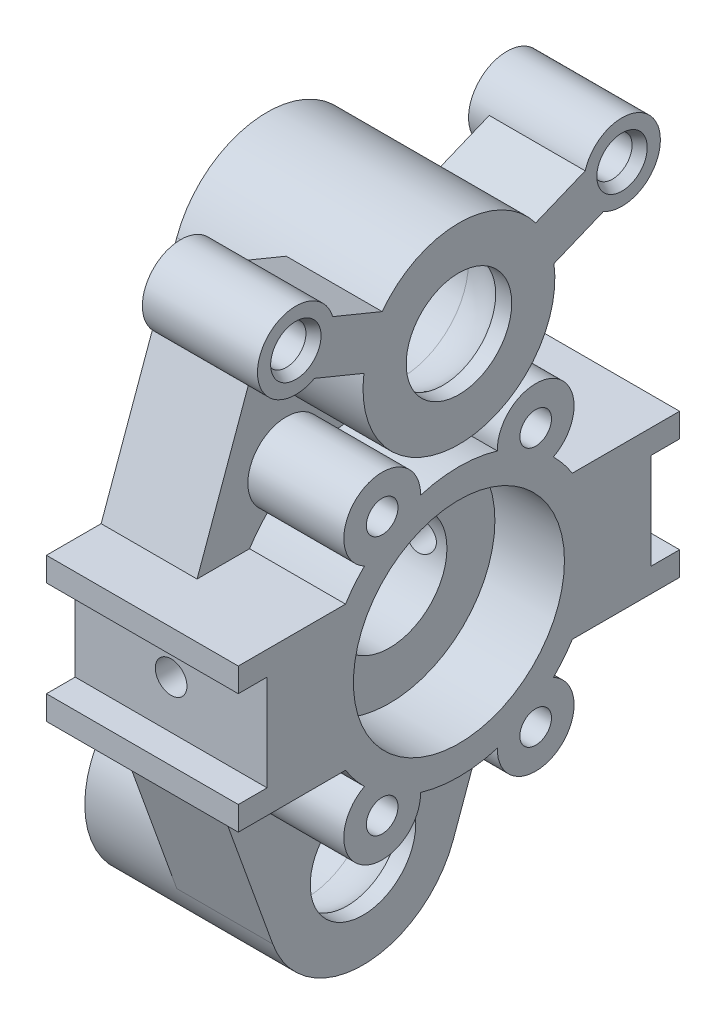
ISO-10303-21;
HEADER;
FILE_DESCRIPTION(('STEP AP214'),'2;1');
FILE_NAME('part.step','',(''),(''),'','','');
FILE_SCHEMA(('AUTOMOTIVE_DESIGN { 1 0 10303 214 1 1 1 1 }'));
ENDSEC;
DATA;
#1=APPLICATION_CONTEXT('core data for automotive mechanical design processes');
#2=APPLICATION_PROTOCOL_DEFINITION('international standard','automotive_design',2000,#1);
#3=PRODUCT_CONTEXT('',#1,'mechanical');
#4=PRODUCT('Part','Part','',(#3));
#5=PRODUCT_RELATED_PRODUCT_CATEGORY('part','',(#4));
#6=PRODUCT_DEFINITION_FORMATION('','',#4);
#7=PRODUCT_DEFINITION_CONTEXT('part definition',#1,'design');
#8=PRODUCT_DEFINITION('design','',#6,#7);
#9=PRODUCT_DEFINITION_SHAPE('','',#8);
#10=(LENGTH_UNIT() NAMED_UNIT(*) SI_UNIT(.MILLI.,.METRE.));
#11=(NAMED_UNIT(*) PLANE_ANGLE_UNIT() SI_UNIT($,.RADIAN.));
#12=(NAMED_UNIT(*) SI_UNIT($,.STERADIAN.) SOLID_ANGLE_UNIT());
#13=UNCERTAINTY_MEASURE_WITH_UNIT(LENGTH_MEASURE(1.E-05),#10,'distance_accuracy_value','');
#14=(GEOMETRIC_REPRESENTATION_CONTEXT(3) GLOBAL_UNCERTAINTY_ASSIGNED_CONTEXT((#13)) GLOBAL_UNIT_ASSIGNED_CONTEXT((#10,
#11,#12)) REPRESENTATION_CONTEXT('',''));
#15=CARTESIAN_POINT('',(0.,0.,0.));
#16=DIRECTION('',(0.,0.,1.));
#17=DIRECTION('',(1.,0.,0.));
#18=AXIS2_PLACEMENT_3D('',#15,#16,#17);
#19=CARTESIAN_POINT('',(-1.,0.,0.));
#20=DIRECTION('',(-1.,0.,0.));
#21=DIRECTION('',(0.,0.,1.));
#22=AXIS2_PLACEMENT_3D('',#19,#20,#21);
#23=PLANE('',#22);
#24=CARTESIAN_POINT('',(-1.,33.,17.));
#25=DIRECTION('',(1.,0.,0.));
#26=DIRECTION('',(0.,0.,-1.));
#27=AXIS2_PLACEMENT_3D('',#24,#25,#26);
#28=CIRCLE('',#27,1.25);
#29=CARTESIAN_POINT('',(-1.,33.,15.75));
#30=VERTEX_POINT('',#29);
#31=EDGE_CURVE('E720',#30,#30,#28,.F.);
#32=ORIENTED_EDGE('',*,*,#31,.T.);
#33=EDGE_LOOP('',(#32));
#34=FACE_BOUND('',#33,.T.);
#35=CARTESIAN_POINT('',(-1.,33.,17.));
#36=DIRECTION('',(-1.,0.,0.));
#37=DIRECTION('',(0.,0.,1.));
#38=AXIS2_PLACEMENT_3D('',#35,#36,#37);
#39=CIRCLE('',#38,2.05);
#40=CARTESIAN_POINT('',(-1.,33.,19.05));
#41=VERTEX_POINT('',#40);
#42=EDGE_CURVE('E1131',#41,#41,#39,.F.);
#43=ORIENTED_EDGE('',*,*,#42,.T.);
#44=EDGE_LOOP('',(#43));
#45=FACE_BOUND('',#44,.T.);
#46=ADVANCED_FACE('F16',(#34,#45),#23,.F.);
#47=CARTESIAN_POINT('',(-1.,0.,0.));
#48=DIRECTION('',(-1.,0.,0.));
#49=DIRECTION('',(0.,0.,1.));
#50=AXIS2_PLACEMENT_3D('',#47,#48,#49);
#51=PLANE('',#50);
#52=CARTESIAN_POINT('',(-1.,33.,-17.));
#53=DIRECTION('',(1.,0.,0.));
#54=DIRECTION('',(0.,0.,-1.));
#55=AXIS2_PLACEMENT_3D('',#52,#53,#54);
#56=CIRCLE('',#55,1.25);
#57=CARTESIAN_POINT('',(-1.,33.,-18.25));
#58=VERTEX_POINT('',#57);
#59=EDGE_CURVE('E20',#58,#58,#56,.F.);
#60=ORIENTED_EDGE('',*,*,#59,.T.);
#61=EDGE_LOOP('',(#60));
#62=FACE_BOUND('',#61,.T.);
#63=CARTESIAN_POINT('',(-1.,33.,-17.));
#64=DIRECTION('',(-1.,0.,0.));
#65=DIRECTION('',(0.,0.,1.));
#66=AXIS2_PLACEMENT_3D('',#63,#64,#65);
#67=CIRCLE('',#66,2.05);
#68=CARTESIAN_POINT('',(-1.,33.,-14.95));
#69=VERTEX_POINT('',#68);
#70=EDGE_CURVE('E1128',#69,#69,#67,.F.);
#71=ORIENTED_EDGE('',*,*,#70,.T.);
#72=EDGE_LOOP('',(#71));
#73=FACE_BOUND('',#72,.T.);
#74=ADVANCED_FACE('F1139',(#62,#73),#51,.F.);
#75=CARTESIAN_POINT('',(-21.9,33.,-17.));
#76=DIRECTION('',(1.,0.,0.));
#77=DIRECTION('',(0.,0.,-1.));
#78=AXIS2_PLACEMENT_3D('',#75,#76,#77);
#79=CYLINDRICAL_SURFACE('',#78,1.25);
#80=ORIENTED_EDGE('',*,*,#59,.F.);
#81=EDGE_LOOP('',(#80));
#82=FACE_BOUND('',#81,.T.);
#83=CARTESIAN_POINT('',(-2.,33.,-17.));
#84=DIRECTION('',(1.,0.,0.));
#85=DIRECTION('',(0.,0.,-1.));
#86=AXIS2_PLACEMENT_3D('',#83,#84,#85);
#87=CIRCLE('',#86,1.25);
#88=CARTESIAN_POINT('',(-2.,33.,-18.25));
#89=VERTEX_POINT('',#88);
#90=EDGE_CURVE('E1125',#89,#89,#87,.F.);
#91=ORIENTED_EDGE('',*,*,#90,.T.);
#92=EDGE_LOOP('',(#91));
#93=FACE_BOUND('',#92,.T.);
#94=ADVANCED_FACE('F1142',(#82,#93),#79,.F.);
#95=CARTESIAN_POINT('',(-21.9,33.,17.));
#96=DIRECTION('',(1.,0.,0.));
#97=DIRECTION('',(0.,0.,-1.));
#98=AXIS2_PLACEMENT_3D('',#95,#96,#97);
#99=CYLINDRICAL_SURFACE('',#98,1.25);
#100=ORIENTED_EDGE('',*,*,#31,.F.);
#101=EDGE_LOOP('',(#100));
#102=FACE_BOUND('',#101,.T.);
#103=CARTESIAN_POINT('',(-2.,33.,17.));
#104=DIRECTION('',(1.,0.,0.));
#105=DIRECTION('',(0.,0.,-1.));
#106=AXIS2_PLACEMENT_3D('',#103,#104,#105);
#107=CIRCLE('',#106,1.25);
#108=CARTESIAN_POINT('',(-2.,33.,15.75));
#109=VERTEX_POINT('',#108);
#110=EDGE_CURVE('E716',#109,#109,#107,.F.);
#111=ORIENTED_EDGE('',*,*,#110,.T.);
#112=EDGE_LOOP('',(#111));
#113=FACE_BOUND('',#112,.T.);
#114=ADVANCED_FACE('F1145',(#102,#113),#99,.F.);
#115=CARTESIAN_POINT('',(-19.95,-26.,0.));
#116=DIRECTION('',(1.,0.,0.));
#117=DIRECTION('',(0.,0.,-1.));
#118=AXIS2_PLACEMENT_3D('',#115,#116,#117);
#119=CYLINDRICAL_SURFACE('',#118,7.);
#120=CARTESIAN_POINT('',(-6.,-26.,0.));
#121=DIRECTION('',(1.,-5.44730927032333E-13,0.));
#122=DIRECTION('',(0.,0.,1.));
#123=AXIS2_PLACEMENT_3D('',#120,#121,#122);
#124=CIRCLE('',#123,7.);
#125=CARTESIAN_POINT('',(-6.,-26.,7.));
#126=VERTEX_POINT('',#125);
#127=CARTESIAN_POINT('',(-6.,-26.,-7.));
#128=VERTEX_POINT('',#127);
#129=EDGE_CURVE('E717',#126,#128,#124,.T.);
#130=ORIENTED_EDGE('',*,*,#129,.T.);
#131=CARTESIAN_POINT('',(-6.,-26.,0.));
#132=DIRECTION('',(1.,1.72257763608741E-11,0.));
#133=DIRECTION('',(0.,0.,-1.));
#134=AXIS2_PLACEMENT_3D('',#131,#132,#133);
#135=CIRCLE('',#134,7.);
#136=EDGE_CURVE('E723',#128,#126,#135,.T.);
#137=ORIENTED_EDGE('',*,*,#136,.T.);
#138=EDGE_LOOP('',(#130,#137));
#139=FACE_BOUND('',#138,.T.);
#140=CARTESIAN_POINT('',(-17.5,-26.,0.));
#141=DIRECTION('',(-1.,0.,0.));
#142=DIRECTION('',(0.,0.,1.));
#143=AXIS2_PLACEMENT_3D('',#140,#141,#142);
#144=CIRCLE('',#143,7.00000000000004);
#145=CARTESIAN_POINT('',(-17.5,-26.,7.00000000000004));
#146=VERTEX_POINT('',#145);
#147=EDGE_CURVE('E712',#146,#146,#144,.T.);
#148=ORIENTED_EDGE('',*,*,#147,.T.);
#149=EDGE_LOOP('',(#148));
#150=FACE_BOUND('',#149,.T.);
#151=ADVANCED_FACE('F1278',(#139,#150),#119,.F.);
#152=CARTESIAN_POINT('',(-6.,-26.,0.));
#153=DIRECTION('',(0.,0.,1.));
#154=DIRECTION('',(0.618589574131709,0.785714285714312,0.));
#155=AXIS2_PLACEMENT_3D('',#152,#153,#154);
#156=SPHERICAL_SURFACE('',#155,7.);
#157=CARTESIAN_POINT('',(-6.,-26.,0.));
#158=DIRECTION('',(-0.618589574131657,-0.785714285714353,0.));
#159=DIRECTION('',(0.,0.,-1.));
#160=AXIS2_PLACEMENT_3D('',#157,#158,#159);
#161=CIRCLE('',#160,7.);
#162=CARTESIAN_POINT('',(-1.669872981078,-29.4090909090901,-4.3160281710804));
#163=VERTEX_POINT('',#162);
#164=EDGE_CURVE('E719',#163,#128,#161,.F.);
#165=ORIENTED_EDGE('',*,*,#164,.T.);
#166=ORIENTED_EDGE('',*,*,#129,.F.);
#167=CARTESIAN_POINT('',(-6.,-26.,0.));
#168=DIRECTION('',(-0.61858957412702,-0.785714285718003,0.));
#169=DIRECTION('',(0.,0.,-1.));
#170=AXIS2_PLACEMENT_3D('',#167,#168,#169);
#171=CIRCLE('',#170,7.);
#172=CARTESIAN_POINT('',(-1.669872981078,-29.4090909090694,4.31602817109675));
#173=VERTEX_POINT('',#172);
#174=EDGE_CURVE('E726',#126,#173,#171,.F.);
#175=ORIENTED_EDGE('',*,*,#174,.T.);
#176=CARTESIAN_POINT('',(-1.669872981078,-26.,0.));
#177=DIRECTION('',(1.,0.,0.));
#178=DIRECTION('',(0.,0.,-1.));
#179=AXIS2_PLACEMENT_3D('',#176,#177,#178);
#180=CIRCLE('',#179,5.5);
#181=EDGE_CURVE('E715',#173,#163,#180,.T.);
#182=ORIENTED_EDGE('',*,*,#181,.T.);
#183=EDGE_LOOP('',(#165,#166,#175,#182));
#184=FACE_BOUND('',#183,.T.);
#185=ADVANCED_FACE('F1260',(#184),#156,.F.);
#186=CARTESIAN_POINT('',(-6.,-26.,0.));
#187=DIRECTION('',(0.,0.,-1.));
#188=DIRECTION('',(-0.618589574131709,-0.785714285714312,0.));
#189=AXIS2_PLACEMENT_3D('',#186,#187,#188);
#190=SPHERICAL_SURFACE('',#189,7.);
#191=ORIENTED_EDGE('',*,*,#136,.F.);
#192=ORIENTED_EDGE('',*,*,#164,.F.);
#193=CARTESIAN_POINT('',(-1.669872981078,-26.,0.));
#194=DIRECTION('',(1.,0.,0.));
#195=DIRECTION('',(0.,0.,-1.));
#196=AXIS2_PLACEMENT_3D('',#193,#194,#195);
#197=CIRCLE('',#196,5.5);
#198=EDGE_CURVE('E704',#163,#173,#197,.T.);
#199=ORIENTED_EDGE('',*,*,#198,.T.);
#200=ORIENTED_EDGE('',*,*,#174,.F.);
#201=EDGE_LOOP('',(#191,#192,#199,#200));
#202=FACE_BOUND('',#201,.T.);
#203=ADVANCED_FACE('F1252',(#202),#190,.F.);
#204=CARTESIAN_POINT('',(-1.,33.,17.));
#205=DIRECTION('',(-1.,0.,0.));
#206=DIRECTION('',(0.,0.,1.));
#207=AXIS2_PLACEMENT_3D('',#204,#205,#206);
#208=CYLINDRICAL_SURFACE('',#207,2.05);
#209=ORIENTED_EDGE('',*,*,#42,.F.);
#210=EDGE_LOOP('',(#209));
#211=FACE_BOUND('',#210,.T.);
#212=CARTESIAN_POINT('',(9.0000753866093,33.,17.));
#213=DIRECTION('',(1.,0.,0.));
#214=DIRECTION('',(0.,0.,-1.));
#215=AXIS2_PLACEMENT_3D('',#212,#213,#214);
#216=CIRCLE('',#215,2.05000000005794);
#217=CARTESIAN_POINT('',(9.0000753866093,33.,14.9499999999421));
#218=VERTEX_POINT('',#217);
#219=EDGE_CURVE('E314',#218,#218,#216,.T.);
#220=ORIENTED_EDGE('',*,*,#219,.T.);
#221=EDGE_LOOP('',(#220));
#222=FACE_BOUND('',#221,.T.);
#223=ADVANCED_FACE('F1246',(#211,#222),#208,.F.);
#224=CARTESIAN_POINT('',(-1.,33.,-17.));
#225=DIRECTION('',(-1.,0.,0.));
#226=DIRECTION('',(0.,0.,1.));
#227=AXIS2_PLACEMENT_3D('',#224,#225,#226);
#228=CYLINDRICAL_SURFACE('',#227,2.05);
#229=ORIENTED_EDGE('',*,*,#70,.F.);
#230=EDGE_LOOP('',(#229));
#231=FACE_BOUND('',#230,.T.);
#232=CARTESIAN_POINT('',(9.0000753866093,33.,-17.));
#233=DIRECTION('',(1.,0.,0.));
#234=DIRECTION('',(0.,0.,-1.));
#235=AXIS2_PLACEMENT_3D('',#232,#233,#234);
#236=CIRCLE('',#235,2.0499999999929);
#237=CARTESIAN_POINT('',(9.0000753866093,33.,-19.0499999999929));
#238=VERTEX_POINT('',#237);
#239=EDGE_CURVE('E707',#238,#238,#236,.T.);
#240=ORIENTED_EDGE('',*,*,#239,.T.);
#241=EDGE_LOOP('',(#240));
#242=FACE_BOUND('',#241,.T.);
#243=ADVANCED_FACE('F1153',(#231,#242),#228,.F.);
#244=CARTESIAN_POINT('',(-2.,0.,0.));
#245=DIRECTION('',(1.,0.,0.));
#246=DIRECTION('',(0.,0.,-1.));
#247=AXIS2_PLACEMENT_3D('',#244,#245,#246);
#248=PLANE('',#247);
#249=ORIENTED_EDGE('',*,*,#90,.F.);
#250=EDGE_LOOP('',(#249));
#251=FACE_BOUND('',#250,.T.);
#252=CARTESIAN_POINT('',(-2.,33.,-17.));
#253=DIRECTION('',(1.,0.,0.));
#254=DIRECTION('',(0.,0.,-1.));
#255=AXIS2_PLACEMENT_3D('',#252,#253,#254);
#256=CIRCLE('',#255,4.);
#257=CARTESIAN_POINT('',(-2.,33.,-21.));
#258=VERTEX_POINT('',#257);
#259=EDGE_CURVE('E696',#258,#258,#256,.T.);
#260=ORIENTED_EDGE('',*,*,#259,.F.);
#261=EDGE_LOOP('',(#260));
#262=FACE_BOUND('',#261,.T.);
#263=ADVANCED_FACE('F1149',(#251,#262),#248,.F.);
#264=CARTESIAN_POINT('',(-2.,0.,0.));
#265=DIRECTION('',(1.,0.,0.));
#266=DIRECTION('',(0.,0.,-1.));
#267=AXIS2_PLACEMENT_3D('',#264,#265,#266);
#268=PLANE('',#267);
#269=ORIENTED_EDGE('',*,*,#110,.F.);
#270=EDGE_LOOP('',(#269));
#271=FACE_BOUND('',#270,.T.);
#272=CARTESIAN_POINT('',(-2.,33.,17.));
#273=DIRECTION('',(1.,0.,0.));
#274=DIRECTION('',(0.,0.,-1.));
#275=AXIS2_PLACEMENT_3D('',#272,#273,#274);
#276=CIRCLE('',#275,4.);
#277=CARTESIAN_POINT('',(-2.,33.,13.));
#278=VERTEX_POINT('',#277);
#279=EDGE_CURVE('E689',#278,#278,#276,.T.);
#280=ORIENTED_EDGE('',*,*,#279,.F.);
#281=EDGE_LOOP('',(#280));
#282=FACE_BOUND('',#281,.T.);
#283=ADVANCED_FACE('F1152',(#271,#282),#268,.F.);
#284=CARTESIAN_POINT('',(2.75,0.,0.));
#285=DIRECTION('',(1.,0.,0.));
#286=DIRECTION('',(0.,0.,-1.));
#287=AXIS2_PLACEMENT_3D('',#284,#285,#286);
#288=PLANE('',#287);
#289=CARTESIAN_POINT('',(2.75,0.,0.));
#290=DIRECTION('',(1.,0.,0.));
#291=DIRECTION('',(0.,0.,-1.));
#292=AXIS2_PLACEMENT_3D('',#289,#290,#291);
#293=CIRCLE('',#292,6.);
#294=CARTESIAN_POINT('',(2.75,0.,-6.));
#295=VERTEX_POINT('',#294);
#296=EDGE_CURVE('E1111',#295,#295,#293,.F.);
#297=ORIENTED_EDGE('',*,*,#296,.T.);
#298=EDGE_LOOP('',(#297));
#299=FACE_BOUND('',#298,.T.);
#300=CARTESIAN_POINT('',(2.75,0.,0.));
#301=DIRECTION('',(1.,0.,0.));
#302=DIRECTION('',(0.,0.,-1.));
#303=AXIS2_PLACEMENT_3D('',#300,#301,#302);
#304=CIRCLE('',#303,11.);
#305=CARTESIAN_POINT('',(2.75,0.,-11.));
#306=VERTEX_POINT('',#305);
#307=EDGE_CURVE('E663',#306,#306,#304,.T.);
#308=ORIENTED_EDGE('',*,*,#307,.T.);
#309=EDGE_LOOP('',(#308));
#310=FACE_BOUND('',#309,.T.);
#311=ADVANCED_FACE('F1214',(#299,#310),#288,.T.);
#312=CARTESIAN_POINT('',(-18.9999999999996,-26.,0.));
#313=DIRECTION('',(-1.,0.,0.));
#314=DIRECTION('',(0.,-1.,0.));
#315=AXIS2_PLACEMENT_3D('',#312,#313,#314);
#316=CONICAL_SURFACE('',#315,7.86602540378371,0.523598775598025);
#317=CARTESIAN_POINT('',(-18.9999999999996,-26.,0.));
#318=DIRECTION('',(-1.,0.,0.));
#319=DIRECTION('',(0.,-1.,0.));
#320=AXIS2_PLACEMENT_3D('',#317,#318,#319);
#321=CIRCLE('',#320,7.86602540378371);
#322=CARTESIAN_POINT('',(-18.9999999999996,-33.8660254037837,0.));
#323=VERTEX_POINT('',#322);
#324=EDGE_CURVE('E667',#323,#323,#321,.T.);
#325=ORIENTED_EDGE('',*,*,#324,.T.);
#326=EDGE_LOOP('',(#325));
#327=FACE_BOUND('',#326,.T.);
#328=ORIENTED_EDGE('',*,*,#147,.F.);
#329=EDGE_LOOP('',(#328));
#330=FACE_BOUND('',#329,.T.);
#331=ADVANCED_FACE('F1216',(#327,#330),#316,.F.);
#332=CARTESIAN_POINT('',(-19.95,-26.,0.));
#333=DIRECTION('',(1.,0.,0.));
#334=DIRECTION('',(0.,0.,-1.));
#335=AXIS2_PLACEMENT_3D('',#332,#333,#334);
#336=CYLINDRICAL_SURFACE('',#335,5.5);
#337=CARTESIAN_POINT('',(0.,-26.,0.));
#338=DIRECTION('',(1.,0.,0.));
#339=DIRECTION('',(0.,0.,-1.));
#340=AXIS2_PLACEMENT_3D('',#337,#338,#339);
#341=CIRCLE('',#340,5.5);
#342=CARTESIAN_POINT('',(0.,-26.,-5.5));
#343=VERTEX_POINT('',#342);
#344=EDGE_CURVE('E827',#343,#343,#341,.F.);
#345=ORIENTED_EDGE('',*,*,#344,.F.);
#346=EDGE_LOOP('',(#345));
#347=FACE_BOUND('',#346,.T.);
#348=ORIENTED_EDGE('',*,*,#181,.F.);
#349=ORIENTED_EDGE('',*,*,#198,.F.);
#350=EDGE_LOOP('',(#348,#349));
#351=FACE_BOUND('',#350,.T.);
#352=ADVANCED_FACE('F1223',(#347,#351),#336,.F.);
#353=CARTESIAN_POINT('',(0.,27.37489889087,-9.905031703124));
#354=DIRECTION('',(0.,-0.924678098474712,-0.380749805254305));
#355=DIRECTION('',(0.,0.380749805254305,-0.924678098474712));
#356=AXIS2_PLACEMENT_3D('',#353,#354,#355);
#357=PLANE('',#356);
#358=DIRECTION('',(0.,-0.380749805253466,0.924678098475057));
#359=VECTOR('',#358,1.);
#360=CARTESIAN_POINT('',(10.,29.49941386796,-15.06456807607));
#361=LINE('',#360,#359);
#362=CARTESIAN_POINT('',(10.,29.4994138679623,-15.0645680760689));
#363=VERTEX_POINT('',#362);
#364=CARTESIAN_POINT('',(10.,27.3748988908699,-9.90503170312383));
#365=VERTEX_POINT('',#364);
#366=EDGE_CURVE('E298',#363,#365,#361,.T.);
#367=ORIENTED_EDGE('',*,*,#366,.T.);
#368=DIRECTION('',(1.,0.,0.));
#369=VECTOR('',#368,1.);
#370=CARTESIAN_POINT('',(0.,27.37489889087,-9.905031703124));
#371=LINE('',#370,#369);
#372=CARTESIAN_POINT('',(0.,27.3748988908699,-9.90503170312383));
#373=VERTEX_POINT('',#372);
#374=EDGE_CURVE('E309',#365,#373,#371,.F.);
#375=ORIENTED_EDGE('',*,*,#374,.T.);
#376=DIRECTION('',(0.,0.380749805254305,-0.924678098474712));
#377=VECTOR('',#376,1.);
#378=CARTESIAN_POINT('',(0.,27.37489889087,-9.905031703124));
#379=LINE('',#378,#377);
#380=CARTESIAN_POINT('',(0.,27.4570342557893,-10.1045033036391));
#381=VERTEX_POINT('',#380);
#382=EDGE_CURVE('E700',#373,#381,#379,.T.);
#383=ORIENTED_EDGE('',*,*,#382,.T.);
#384=DIRECTION('',(0.,0.38074980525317,-0.924678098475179));
#385=VECTOR('',#384,1.);
#386=CARTESIAN_POINT('',(0.,27.45703425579,-10.10450330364));
#387=LINE('',#386,#385);
#388=CARTESIAN_POINT('',(0.,29.4994138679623,-15.0645680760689));
#389=VERTEX_POINT('',#388);
#390=EDGE_CURVE('E681',#381,#389,#387,.T.);
#391=ORIENTED_EDGE('',*,*,#390,.T.);
#392=DIRECTION('',(1.,0.,0.));
#393=VECTOR('',#392,1.);
#394=CARTESIAN_POINT('',(0.,29.4994138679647,-15.0645680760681));
#395=LINE('',#394,#393);
#396=EDGE_CURVE('E315',#389,#363,#395,.T.);
#397=ORIENTED_EDGE('',*,*,#396,.T.);
#398=EDGE_LOOP('',(#367,#375,#383,#391,#397));
#399=FACE_BOUND('',#398,.T.);
#400=ADVANCED_FACE('F317',(#399),#357,.T.);
#401=CARTESIAN_POINT('',(9.99999999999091,33.,17.));
#402=DIRECTION('',(1.,0.,0.));
#403=DIRECTION('',(0.,0.,-1.));
#404=AXIS2_PLACEMENT_3D('',#401,#402,#403);
#405=CONICAL_SURFACE('',#404,2.62729448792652,0.523589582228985);
#406=CARTESIAN_POINT('',(9.99999999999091,33.,17.));
#407=DIRECTION('',(1.,0.,0.));
#408=DIRECTION('',(0.,0.,-1.));
#409=AXIS2_PLACEMENT_3D('',#406,#407,#408);
#410=CIRCLE('',#409,2.62729448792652);
#411=CARTESIAN_POINT('',(9.99999999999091,33.,14.3727055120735));
#412=VERTEX_POINT('',#411);
#413=EDGE_CURVE('E320',#412,#412,#410,.T.);
#414=ORIENTED_EDGE('',*,*,#413,.T.);
#415=EDGE_LOOP('',(#414));
#416=FACE_BOUND('',#415,.T.);
#417=ORIENTED_EDGE('',*,*,#219,.F.);
#418=EDGE_LOOP('',(#417));
#419=FACE_BOUND('',#418,.T.);
#420=ADVANCED_FACE('F1234',(#416,#419),#405,.F.);
#421=CARTESIAN_POINT('',(9.99999999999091,33.,-17.));
#422=DIRECTION('',(1.,0.,0.));
#423=DIRECTION('',(0.,0.,-1.));
#424=AXIS2_PLACEMENT_3D('',#421,#422,#423);
#425=CONICAL_SURFACE('',#424,2.62729448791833,0.523589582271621);
#426=CARTESIAN_POINT('',(9.99999999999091,33.,-17.));
#427=DIRECTION('',(1.,0.,0.));
#428=DIRECTION('',(0.,0.,-1.));
#429=AXIS2_PLACEMENT_3D('',#426,#427,#428);
#430=CIRCLE('',#429,2.62729448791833);
#431=CARTESIAN_POINT('',(9.99999999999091,33.,-19.6272944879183));
#432=VERTEX_POINT('',#431);
#433=EDGE_CURVE('E324',#432,#432,#430,.T.);
#434=ORIENTED_EDGE('',*,*,#433,.T.);
#435=EDGE_LOOP('',(#434));
#436=FACE_BOUND('',#435,.T.);
#437=ORIENTED_EDGE('',*,*,#239,.F.);
#438=EDGE_LOOP('',(#437));
#439=FACE_BOUND('',#438,.T.);
#440=ADVANCED_FACE('F1170',(#436,#439),#425,.F.);
#441=CARTESIAN_POINT('',(-11.,26.,0.));
#442=DIRECTION('',(1.,0.,0.));
#443=DIRECTION('',(0.,0.,-1.));
#444=AXIS2_PLACEMENT_3D('',#441,#442,#443);
#445=CYLINDRICAL_SURFACE('',#444,5.5);
#446=CARTESIAN_POINT('',(10.,26.,0.));
#447=DIRECTION('',(1.,0.,0.));
#448=DIRECTION('',(0.,0.,-1.));
#449=AXIS2_PLACEMENT_3D('',#446,#447,#448);
#450=CIRCLE('',#449,5.5);
#451=CARTESIAN_POINT('',(10.,26.,-5.5));
#452=VERTEX_POINT('',#451);
#453=EDGE_CURVE('E575',#452,#452,#450,.T.);
#454=ORIENTED_EDGE('',*,*,#453,.T.);
#455=EDGE_LOOP('',(#454));
#456=FACE_BOUND('',#455,.T.);
#457=CARTESIAN_POINT('',(8.330127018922,26.,0.));
#458=DIRECTION('',(1.,0.,0.));
#459=DIRECTION('',(0.,0.,-1.));
#460=AXIS2_PLACEMENT_3D('',#457,#458,#459);
#461=CIRCLE('',#460,5.5);
#462=CARTESIAN_POINT('',(8.330127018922,26.,-5.5));
#463=VERTEX_POINT('',#462);
#464=EDGE_CURVE('E1107',#463,#463,#461,.F.);
#465=ORIENTED_EDGE('',*,*,#464,.T.);
#466=EDGE_LOOP('',(#465));
#467=FACE_BOUND('',#466,.T.);
#468=ADVANCED_FACE('F1160',(#456,#467),#445,.F.);
#469=CARTESIAN_POINT('',(10.,33.,-17.));
#470=DIRECTION('',(1.,0.,0.));
#471=DIRECTION('',(0.,0.,-1.));
#472=AXIS2_PLACEMENT_3D('',#469,#470,#471);
#473=CYLINDRICAL_SURFACE('',#472,4.);
#474=ORIENTED_EDGE('',*,*,#396,.F.);
#475=CARTESIAN_POINT('',(0.,33.,-17.));
#476=DIRECTION('',(1.,0.,0.));
#477=DIRECTION('',(0.,0.,-1.));
#478=AXIS2_PLACEMENT_3D('',#475,#476,#477);
#479=CIRCLE('',#478,4.);
#480=CARTESIAN_POINT('',(0.,34.1228043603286,-13.1608190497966));
#481=VERTEX_POINT('',#480);
#482=EDGE_CURVE('E691',#389,#481,#479,.F.);
#483=ORIENTED_EDGE('',*,*,#482,.T.);
#484=DIRECTION('',(1.,0.,0.));
#485=VECTOR('',#484,1.);
#486=CARTESIAN_POINT('',(0.,34.12280436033,-13.1608190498));
#487=LINE('',#486,#485);
#488=CARTESIAN_POINT('',(10.,34.1228043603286,-13.1608190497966));
#489=VERTEX_POINT('',#488);
#490=EDGE_CURVE('E574',#489,#481,#487,.F.);
#491=ORIENTED_EDGE('',*,*,#490,.F.);
#492=CARTESIAN_POINT('',(10.,33.,-17.));
#493=DIRECTION('',(1.,0.,0.));
#494=DIRECTION('',(0.,0.,-1.));
#495=AXIS2_PLACEMENT_3D('',#492,#493,#494);
#496=CIRCLE('',#495,4.);
#497=EDGE_CURVE('E321',#489,#363,#496,.F.);
#498=ORIENTED_EDGE('',*,*,#497,.T.);
#499=EDGE_LOOP('',(#474,#483,#491,#498));
#500=FACE_BOUND('',#499,.T.);
#501=ORIENTED_EDGE('',*,*,#259,.T.);
#502=EDGE_LOOP('',(#501));
#503=FACE_BOUND('',#502,.T.);
#504=ADVANCED_FACE('F1157',(#500,#503),#473,.T.);
#505=CARTESIAN_POINT('',(0.,29.49941386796,15.06456807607));
#506=DIRECTION('',(0.,-0.924678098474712,0.380749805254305));
#507=DIRECTION('',(0.,-0.380749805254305,-0.924678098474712));
#508=AXIS2_PLACEMENT_3D('',#505,#506,#507);
#509=PLANE('',#508);
#510=DIRECTION('',(1.,0.,0.));
#511=VECTOR('',#510,1.);
#512=CARTESIAN_POINT('',(10.,29.4994138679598,15.0645680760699));
#513=LINE('',#512,#511);
#514=CARTESIAN_POINT('',(0.,29.4994138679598,15.0645680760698));
#515=VERTEX_POINT('',#514);
#516=CARTESIAN_POINT('',(10.,29.4994138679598,15.0645680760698));
#517=VERTEX_POINT('',#516);
#518=EDGE_CURVE('E677',#515,#517,#513,.T.);
#519=ORIENTED_EDGE('',*,*,#518,.F.);
#520=DIRECTION('',(0.,-0.38074980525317,-0.924678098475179));
#521=VECTOR('',#520,1.);
#522=CARTESIAN_POINT('',(0.,29.49941386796,15.06456807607));
#523=LINE('',#522,#521);
#524=CARTESIAN_POINT('',(0.,27.4570342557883,10.1045033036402));
#525=VERTEX_POINT('',#524);
#526=EDGE_CURVE('E340',#515,#525,#523,.T.);
#527=ORIENTED_EDGE('',*,*,#526,.T.);
#528=DIRECTION('',(0.,-0.380749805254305,-0.924678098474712));
#529=VECTOR('',#528,1.);
#530=CARTESIAN_POINT('',(0.,29.49941386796,15.06456807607));
#531=LINE('',#530,#529);
#532=CARTESIAN_POINT('',(0.,27.3748988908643,9.9050317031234));
#533=VERTEX_POINT('',#532);
#534=EDGE_CURVE('E692',#525,#533,#531,.T.);
#535=ORIENTED_EDGE('',*,*,#534,.T.);
#536=DIRECTION('',(1.,0.,0.));
#537=VECTOR('',#536,1.);
#538=CARTESIAN_POINT('',(0.,27.3748988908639,9.90503170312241));
#539=LINE('',#538,#537);
#540=CARTESIAN_POINT('',(10.,27.3748988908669,9.90503170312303));
#541=VERTEX_POINT('',#540);
#542=EDGE_CURVE('E695',#533,#541,#539,.T.);
#543=ORIENTED_EDGE('',*,*,#542,.T.);
#544=DIRECTION('',(0.,0.380749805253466,0.924678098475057));
#545=VECTOR('',#544,1.);
#546=CARTESIAN_POINT('',(10.,27.37489889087,9.905031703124));
#547=LINE('',#546,#545);
#548=EDGE_CURVE('E301',#541,#517,#547,.T.);
#549=ORIENTED_EDGE('',*,*,#548,.T.);
#550=EDGE_LOOP('',(#519,#527,#535,#543,#549));
#551=FACE_BOUND('',#550,.T.);
#552=ADVANCED_FACE('F1159',(#551),#509,.T.);
#553=CARTESIAN_POINT('',(10.,33.,17.));
#554=DIRECTION('',(1.,0.,0.));
#555=DIRECTION('',(0.,0.,-1.));
#556=AXIS2_PLACEMENT_3D('',#553,#554,#555);
#557=CYLINDRICAL_SURFACE('',#556,4.);
#558=DIRECTION('',(1.,0.,0.));
#559=VECTOR('',#558,1.);
#560=CARTESIAN_POINT('',(0.,34.122804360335,13.1608190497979));
#561=LINE('',#560,#559);
#562=CARTESIAN_POINT('',(0.,34.1228043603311,13.1608190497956));
#563=VERTEX_POINT('',#562);
#564=CARTESIAN_POINT('',(10.,34.1228043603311,13.1608190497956));
#565=VERTEX_POINT('',#564);
#566=EDGE_CURVE('E305',#563,#565,#561,.T.);
#567=ORIENTED_EDGE('',*,*,#566,.F.);
#568=CARTESIAN_POINT('',(0.,33.,17.));
#569=DIRECTION('',(1.,0.,0.));
#570=DIRECTION('',(0.,0.,-1.));
#571=AXIS2_PLACEMENT_3D('',#568,#569,#570);
#572=CIRCLE('',#571,4.);
#573=EDGE_CURVE('E339',#563,#515,#572,.F.);
#574=ORIENTED_EDGE('',*,*,#573,.T.);
#575=ORIENTED_EDGE('',*,*,#518,.T.);
#576=CARTESIAN_POINT('',(10.,33.,17.));
#577=DIRECTION('',(1.,0.,0.));
#578=DIRECTION('',(0.,0.,-1.));
#579=AXIS2_PLACEMENT_3D('',#576,#577,#578);
#580=CIRCLE('',#579,4.);
#581=EDGE_CURVE('E334',#517,#565,#580,.F.);
#582=ORIENTED_EDGE('',*,*,#581,.T.);
#583=EDGE_LOOP('',(#567,#574,#575,#582));
#584=FACE_BOUND('',#583,.T.);
#585=ORIENTED_EDGE('',*,*,#279,.T.);
#586=EDGE_LOOP('',(#585));
#587=FACE_BOUND('',#586,.T.);
#588=ADVANCED_FACE('F1167',(#584,#587),#557,.T.);
#589=CARTESIAN_POINT('',(0.,26.,0.));
#590=DIRECTION('',(1.,0.,0.));
#591=DIRECTION('',(0.,0.,-1.));
#592=AXIS2_PLACEMENT_3D('',#589,#590,#591);
#593=CYLINDRICAL_SURFACE('',#592,10.);
#594=CARTESIAN_POINT('',(10.,26.,0.));
#595=DIRECTION('',(1.,0.,0.));
#596=DIRECTION('',(0.,0.,-1.));
#597=AXIS2_PLACEMENT_3D('',#594,#595,#596);
#598=CIRCLE('',#597,10.);
#599=EDGE_CURVE('E294',#365,#541,#598,.F.);
#600=ORIENTED_EDGE('',*,*,#599,.T.);
#601=ORIENTED_EDGE('',*,*,#542,.F.);
#602=CARTESIAN_POINT('',(0.,26.,0.));
#603=DIRECTION('',(1.,0.,0.));
#604=DIRECTION('',(0.,0.,-1.));
#605=AXIS2_PLACEMENT_3D('',#602,#603,#604);
#606=CIRCLE('',#605,10.);
#607=EDGE_CURVE('E311',#373,#533,#606,.F.);
#608=ORIENTED_EDGE('',*,*,#607,.F.);
#609=ORIENTED_EDGE('',*,*,#374,.F.);
#610=EDGE_LOOP('',(#600,#601,#608,#609));
#611=FACE_BOUND('',#610,.T.);
#612=ADVANCED_FACE('F310',(#611),#593,.T.);
#613=CARTESIAN_POINT('',(0.,-13.5,-8.));
#614=DIRECTION('',(1.,0.,0.));
#615=DIRECTION('',(0.,0.,-1.));
#616=AXIS2_PLACEMENT_3D('',#613,#614,#615);
#617=CYLINDRICAL_SURFACE('',#616,4.);
#618=CARTESIAN_POINT('',(10.,-13.5,-8.));
#619=DIRECTION('',(1.,0.,0.));
#620=DIRECTION('',(0.,0.,-1.));
#621=AXIS2_PLACEMENT_3D('',#618,#619,#620);
#622=CIRCLE('',#621,4.);
#623=CARTESIAN_POINT('',(10.,-13.4161457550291,-4.00087903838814));
#624=VERTEX_POINT('',#623);
#625=CARTESIAN_POINT('',(10.,-9.9518745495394,-9.84683669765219));
#626=VERTEX_POINT('',#625);
#627=EDGE_CURVE('E796',#624,#626,#622,.T.);
#628=ORIENTED_EDGE('',*,*,#627,.F.);
#629=DIRECTION('',(1.,0.,0.));
#630=VECTOR('',#629,1.);
#631=CARTESIAN_POINT('',(-10.,-13.4161457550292,-4.00087903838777));
#632=LINE('',#631,#630);
#633=CARTESIAN_POINT('',(0.,-13.4161457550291,-4.00087903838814));
#634=VERTEX_POINT('',#633);
#635=EDGE_CURVE('E656',#634,#624,#632,.T.);
#636=ORIENTED_EDGE('',*,*,#635,.F.);
#637=CARTESIAN_POINT('',(0.,-13.5,-8.));
#638=DIRECTION('',(1.,0.,0.));
#639=DIRECTION('',(0.,0.,-1.));
#640=AXIS2_PLACEMENT_3D('',#637,#638,#639);
#641=CIRCLE('',#640,4.);
#642=CARTESIAN_POINT('',(0.,-9.9518745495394,-9.84683669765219));
#643=VERTEX_POINT('',#642);
#644=EDGE_CURVE('E686',#643,#634,#641,.F.);
#645=ORIENTED_EDGE('',*,*,#644,.F.);
#646=DIRECTION('',(1.,0.,0.));
#647=VECTOR('',#646,1.);
#648=CARTESIAN_POINT('',(-10.,-9.9518745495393,-9.8468366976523));
#649=LINE('',#648,#647);
#650=EDGE_CURVE('E683',#626,#643,#649,.F.);
#651=ORIENTED_EDGE('',*,*,#650,.F.);
#652=EDGE_LOOP('',(#628,#636,#645,#651));
#653=FACE_BOUND('',#652,.T.);
#654=ADVANCED_FACE('F1180',(#653),#617,.T.);
#655=CARTESIAN_POINT('',(0.,13.5,-8.));
#656=DIRECTION('',(1.,0.,0.));
#657=DIRECTION('',(0.,0.,-1.));
#658=AXIS2_PLACEMENT_3D('',#655,#656,#657);
#659=CYLINDRICAL_SURFACE('',#658,4.);
#660=CARTESIAN_POINT('',(10.,13.5,-8.));
#661=DIRECTION('',(1.,0.,0.));
#662=DIRECTION('',(0.,0.,-1.));
#663=AXIS2_PLACEMENT_3D('',#660,#661,#662);
#664=CIRCLE('',#663,4.);
#665=CARTESIAN_POINT('',(10.,9.95187454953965,-9.84683669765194));
#666=VERTEX_POINT('',#665);
#667=CARTESIAN_POINT('',(10.,13.416145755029,-4.00087903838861));
#668=VERTEX_POINT('',#667);
#669=EDGE_CURVE('E789',#666,#668,#664,.T.);
#670=ORIENTED_EDGE('',*,*,#669,.F.);
#671=DIRECTION('',(1.,0.,0.));
#672=VECTOR('',#671,1.);
#673=CARTESIAN_POINT('',(-10.,9.95187454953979,-9.8468366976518));
#674=LINE('',#673,#672);
#675=CARTESIAN_POINT('',(0.,9.95187454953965,-9.84683669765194));
#676=VERTEX_POINT('',#675);
#677=EDGE_CURVE('E678',#676,#666,#674,.T.);
#678=ORIENTED_EDGE('',*,*,#677,.F.);
#679=CARTESIAN_POINT('',(0.,13.5,-8.));
#680=DIRECTION('',(1.,0.,0.));
#681=DIRECTION('',(0.,0.,-1.));
#682=AXIS2_PLACEMENT_3D('',#679,#680,#681);
#683=CIRCLE('',#682,4.);
#684=CARTESIAN_POINT('',(0.,13.416145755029,-4.00087903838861));
#685=VERTEX_POINT('',#684);
#686=EDGE_CURVE('E800',#685,#676,#683,.F.);
#687=ORIENTED_EDGE('',*,*,#686,.F.);
#688=DIRECTION('',(1.,0.,0.));
#689=VECTOR('',#688,1.);
#690=CARTESIAN_POINT('',(-10.,13.416145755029,-4.00087903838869));
#691=LINE('',#690,#689);
#692=EDGE_CURVE('E674',#668,#685,#691,.F.);
#693=ORIENTED_EDGE('',*,*,#692,.F.);
#694=EDGE_LOOP('',(#670,#678,#687,#693));
#695=FACE_BOUND('',#694,.T.);
#696=ADVANCED_FACE('F1183',(#695),#659,.T.);
#697=CARTESIAN_POINT('',(-10.,0.,0.));
#698=DIRECTION('',(1.,0.,0.));
#699=DIRECTION('',(0.,0.,-1.));
#700=AXIS2_PLACEMENT_3D('',#697,#698,#699);
#701=CYLINDRICAL_SURFACE('',#700,14.);
#702=DIRECTION('',(1.,0.,0.));
#703=VECTOR('',#702,1.);
#704=CARTESIAN_POINT('',(-10.,13.4161457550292,4.00087903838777));
#705=LINE('',#704,#703);
#706=CARTESIAN_POINT('',(0.,13.4161457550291,4.00087903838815));
#707=VERTEX_POINT('',#706);
#708=CARTESIAN_POINT('',(10.,13.4161457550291,4.00087903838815));
#709=VERTEX_POINT('',#708);
#710=EDGE_CURVE('E660',#707,#709,#705,.T.);
#711=ORIENTED_EDGE('',*,*,#710,.T.);
#712=CARTESIAN_POINT('',(10.,0.,0.));
#713=DIRECTION('',(1.,0.,0.));
#714=DIRECTION('',(0.,0.,-1.));
#715=AXIS2_PLACEMENT_3D('',#712,#713,#714);
#716=CIRCLE('',#715,14.);
#717=EDGE_CURVE('E786',#668,#709,#716,.T.);
#718=ORIENTED_EDGE('',*,*,#717,.F.);
#719=ORIENTED_EDGE('',*,*,#692,.T.);
#720=CARTESIAN_POINT('',(0.,0.,0.));
#721=DIRECTION('',(1.,0.,0.));
#722=DIRECTION('',(0.,0.,-1.));
#723=AXIS2_PLACEMENT_3D('',#720,#721,#722);
#724=CIRCLE('',#723,14.);
#725=EDGE_CURVE('E802',#707,#685,#724,.F.);
#726=ORIENTED_EDGE('',*,*,#725,.F.);
#727=EDGE_LOOP('',(#711,#718,#719,#726));
#728=FACE_BOUND('',#727,.T.);
#729=ADVANCED_FACE('F1187',(#728),#701,.T.);
#730=CARTESIAN_POINT('',(0.,13.5,8.));
#731=DIRECTION('',(1.,0.,0.));
#732=DIRECTION('',(0.,0.,-1.));
#733=AXIS2_PLACEMENT_3D('',#730,#731,#732);
#734=CYLINDRICAL_SURFACE('',#733,4.);
#735=CARTESIAN_POINT('',(10.,13.5,8.));
#736=DIRECTION('',(1.,0.,0.));
#737=DIRECTION('',(0.,0.,-1.));
#738=AXIS2_PLACEMENT_3D('',#735,#736,#737);
#739=CIRCLE('',#738,4.);
#740=CARTESIAN_POINT('',(10.,9.95187454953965,9.84683669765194));
#741=VERTEX_POINT('',#740);
#742=EDGE_CURVE('E784',#709,#741,#739,.T.);
#743=ORIENTED_EDGE('',*,*,#742,.F.);
#744=ORIENTED_EDGE('',*,*,#710,.F.);
#745=CARTESIAN_POINT('',(0.,13.5,8.));
#746=DIRECTION('',(1.,0.,0.));
#747=DIRECTION('',(0.,0.,-1.));
#748=AXIS2_PLACEMENT_3D('',#745,#746,#747);
#749=CIRCLE('',#748,4.);
#750=CARTESIAN_POINT('',(0.,9.95187454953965,9.84683669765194));
#751=VERTEX_POINT('',#750);
#752=EDGE_CURVE('E805',#751,#707,#749,.F.);
#753=ORIENTED_EDGE('',*,*,#752,.F.);
#754=DIRECTION('',(1.,0.,0.));
#755=VECTOR('',#754,1.);
#756=CARTESIAN_POINT('',(-10.,9.9518745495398,9.8468366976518));
#757=LINE('',#756,#755);
#758=EDGE_CURVE('E669',#741,#751,#757,.F.);
#759=ORIENTED_EDGE('',*,*,#758,.F.);
#760=EDGE_LOOP('',(#743,#744,#753,#759));
#761=FACE_BOUND('',#760,.T.);
#762=ADVANCED_FACE('F1191',(#761),#734,.T.);
#763=CARTESIAN_POINT('',(0.,-13.5,8.));
#764=DIRECTION('',(1.,0.,0.));
#765=DIRECTION('',(0.,0.,-1.));
#766=AXIS2_PLACEMENT_3D('',#763,#764,#765);
#767=CYLINDRICAL_SURFACE('',#766,4.);
#768=CARTESIAN_POINT('',(10.,-13.5,8.));
#769=DIRECTION('',(1.,0.,0.));
#770=DIRECTION('',(0.,0.,-1.));
#771=AXIS2_PLACEMENT_3D('',#768,#769,#770);
#772=CIRCLE('',#771,4.);
#773=CARTESIAN_POINT('',(10.,-9.9518745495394,9.84683669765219));
#774=VERTEX_POINT('',#773);
#775=CARTESIAN_POINT('',(10.,-13.416145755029,4.00087903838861));
#776=VERTEX_POINT('',#775);
#777=EDGE_CURVE('E777',#774,#776,#772,.T.);
#778=ORIENTED_EDGE('',*,*,#777,.F.);
#779=DIRECTION('',(1.,0.,0.));
#780=VECTOR('',#779,1.);
#781=CARTESIAN_POINT('',(-10.,-9.9518745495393,9.8468366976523));
#782=LINE('',#781,#780);
#783=CARTESIAN_POINT('',(0.,-9.9518745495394,9.84683669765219));
#784=VERTEX_POINT('',#783);
#785=EDGE_CURVE('E664',#784,#774,#782,.T.);
#786=ORIENTED_EDGE('',*,*,#785,.F.);
#787=CARTESIAN_POINT('',(0.,-13.5,8.));
#788=DIRECTION('',(1.,0.,0.));
#789=DIRECTION('',(0.,0.,-1.));
#790=AXIS2_PLACEMENT_3D('',#787,#788,#789);
#791=CIRCLE('',#790,4.);
#792=CARTESIAN_POINT('',(0.,-13.416145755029,4.00087903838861));
#793=VERTEX_POINT('',#792);
#794=EDGE_CURVE('E1611',#793,#784,#791,.F.);
#795=ORIENTED_EDGE('',*,*,#794,.F.);
#796=DIRECTION('',(1.,0.,0.));
#797=VECTOR('',#796,1.);
#798=CARTESIAN_POINT('',(-10.,-13.416145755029,4.00087903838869));
#799=LINE('',#798,#797);
#800=EDGE_CURVE('E659',#776,#793,#799,.F.);
#801=ORIENTED_EDGE('',*,*,#800,.F.);
#802=EDGE_LOOP('',(#778,#786,#795,#801));
#803=FACE_BOUND('',#802,.T.);
#804=ADVANCED_FACE('F1195',(#803),#767,.T.);
#805=CARTESIAN_POINT('',(-10.,0.,0.));
#806=DIRECTION('',(1.,0.,0.));
#807=DIRECTION('',(0.,0.,-1.));
#808=AXIS2_PLACEMENT_3D('',#805,#806,#807);
#809=CYLINDRICAL_SURFACE('',#808,14.);
#810=ORIENTED_EDGE('',*,*,#800,.T.);
#811=CARTESIAN_POINT('',(0.,0.,0.));
#812=DIRECTION('',(1.,0.,0.));
#813=DIRECTION('',(0.,0.,-1.));
#814=AXIS2_PLACEMENT_3D('',#811,#812,#813);
#815=CIRCLE('',#814,14.);
#816=EDGE_CURVE('E1614',#634,#793,#815,.F.);
#817=ORIENTED_EDGE('',*,*,#816,.F.);
#818=ORIENTED_EDGE('',*,*,#635,.T.);
#819=CARTESIAN_POINT('',(10.,0.,0.));
#820=DIRECTION('',(1.,0.,0.));
#821=DIRECTION('',(0.,0.,-1.));
#822=AXIS2_PLACEMENT_3D('',#819,#820,#821);
#823=CIRCLE('',#822,14.);
#824=EDGE_CURVE('E774',#776,#624,#823,.T.);
#825=ORIENTED_EDGE('',*,*,#824,.F.);
#826=EDGE_LOOP('',(#810,#817,#818,#825));
#827=FACE_BOUND('',#826,.T.);
#828=ADVANCED_FACE('F1199',(#827),#809,.T.);
#829=CARTESIAN_POINT('',(2.75,0.,0.));
#830=DIRECTION('',(1.,0.,0.));
#831=DIRECTION('',(0.,0.,-1.));
#832=AXIS2_PLACEMENT_3D('',#829,#830,#831);
#833=CYLINDRICAL_SURFACE('',#832,11.);
#834=CARTESIAN_POINT('',(10.,0.,0.));
#835=DIRECTION('',(1.,0.,0.));
#836=DIRECTION('',(0.,0.,-1.));
#837=AXIS2_PLACEMENT_3D('',#834,#835,#836);
#838=CIRCLE('',#837,11.);
#839=CARTESIAN_POINT('',(10.,0.,-11.));
#840=VERTEX_POINT('',#839);
#841=EDGE_CURVE('E771',#840,#840,#838,.F.);
#842=ORIENTED_EDGE('',*,*,#841,.F.);
#843=EDGE_LOOP('',(#842));
#844=FACE_BOUND('',#843,.T.);
#845=ORIENTED_EDGE('',*,*,#307,.F.);
#846=EDGE_LOOP('',(#845));
#847=FACE_BOUND('',#846,.T.);
#848=ADVANCED_FACE('F1202',(#844,#847),#833,.F.);
#849=CARTESIAN_POINT('',(2.75,0.,0.));
#850=DIRECTION('',(1.,0.,0.));
#851=DIRECTION('',(0.,0.,-1.));
#852=AXIS2_PLACEMENT_3D('',#849,#850,#851);
#853=CYLINDRICAL_SURFACE('',#852,6.);
#854=CARTESIAN_POINT('',(-1.65,0.,6.));
#855=CARTESIAN_POINT('',(-1.64999521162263,-0.0907425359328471,5.99999701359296));
#856=CARTESIAN_POINT('',(-1.6424806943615,-0.181588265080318,5.99791871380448));
#857=CARTESIAN_POINT('',(-1.61265050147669,-0.360740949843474,5.98981998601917));
#858=CARTESIAN_POINT('',(-1.59030781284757,-0.449042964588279,5.98379236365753));
#859=CARTESIAN_POINT('',(-1.53160785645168,-0.620369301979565,5.96846087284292));
#860=CARTESIAN_POINT('',(-1.49527692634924,-0.703403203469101,5.95916316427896));
#861=CARTESIAN_POINT('',(-1.40971466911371,-0.862171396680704,5.93827253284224));
#862=CARTESIAN_POINT('',(-1.36048616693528,-0.937907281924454,5.9266801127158));
#863=CARTESIAN_POINT('',(-1.24923966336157,-1.08182909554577,5.90212658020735));
#864=CARTESIAN_POINT('',(-1.18696213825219,-1.14981023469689,5.88914080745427));
#865=CARTESIAN_POINT('',(-1.05193684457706,-1.27451056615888,5.86341928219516));
#866=CARTESIAN_POINT('',(-0.979187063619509,-1.33122758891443,5.85068357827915));
#867=CARTESIAN_POINT('',(-0.823637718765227,-1.43279584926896,5.82665240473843));
#868=CARTESIAN_POINT('',(-0.740677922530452,-1.47740965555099,5.81538773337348));
#869=CARTESIAN_POINT('',(-0.56807527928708,-1.55197395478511,5.79593583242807));
#870=CARTESIAN_POINT('',(-0.47843380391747,-1.58192744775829,5.7877479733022));
#871=CARTESIAN_POINT('',(-0.297275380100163,-1.62560748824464,5.77563041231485));
#872=CARTESIAN_POINT('',(-0.205854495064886,-1.63970483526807,5.77160359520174));
#873=CARTESIAN_POINT('',(-0.0218633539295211,-1.65242890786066,5.76797418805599));
#874=CARTESIAN_POINT('',(0.0707066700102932,-1.65105870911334,5.76837071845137));
#875=CARTESIAN_POINT('',(0.251445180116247,-1.63318024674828,5.77345647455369));
#876=CARTESIAN_POINT('',(0.339662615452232,-1.61712446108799,5.77801738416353));
#877=CARTESIAN_POINT('',(0.512101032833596,-1.57105663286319,5.7907120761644));
#878=CARTESIAN_POINT('',(0.596321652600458,-1.54104332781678,5.79884618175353));
#879=CARTESIAN_POINT('',(0.759539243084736,-1.46755142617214,5.81788131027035));
#880=CARTESIAN_POINT('',(0.838462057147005,-1.42391672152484,5.8288141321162));
#881=CARTESIAN_POINT('',(0.988017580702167,-1.32453231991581,5.85219729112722));
#882=CARTESIAN_POINT('',(1.05864908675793,-1.26878086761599,5.86464784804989));
#883=CARTESIAN_POINT('',(1.19219243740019,-1.14445803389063,5.89019294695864));
#884=CARTESIAN_POINT('',(1.25475237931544,-1.07550965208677,5.90329486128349));
#885=CARTESIAN_POINT('',(1.36752085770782,-0.9279081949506,5.92828647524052));
#886=CARTESIAN_POINT('',(1.41772410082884,-0.849250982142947,5.94017565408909));
#887=CARTESIAN_POINT('',(1.5045226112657,-0.683874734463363,5.96148497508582));
#888=CARTESIAN_POINT('',(1.54104012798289,-0.597113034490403,5.97089092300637));
#889=CARTESIAN_POINT('',(1.59880057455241,-0.418465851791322,5.98605683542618));
#890=CARTESIAN_POINT('',(1.62007517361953,-0.326591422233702,5.99182435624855));
#891=CARTESIAN_POINT('',(1.63891131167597,-0.194942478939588,5.99695843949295));
#892=CARTESIAN_POINT('',(1.64306526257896,-0.156084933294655,5.99809605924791));
#893=CARTESIAN_POINT('',(1.64861064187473,-0.0781579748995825,5.9996174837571));
#894=CARTESIAN_POINT('',(1.65000206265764,-0.0390885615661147,6.0000012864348));
#895=CARTESIAN_POINT('',(1.64999521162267,0.090742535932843,5.99999701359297));
#896=CARTESIAN_POINT('',(1.64248069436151,0.181588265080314,5.99791871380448));
#897=CARTESIAN_POINT('',(1.61265050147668,0.360740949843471,5.98981998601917));
#898=CARTESIAN_POINT('',(1.59030781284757,0.449042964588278,5.98379236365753));
#899=CARTESIAN_POINT('',(1.53160785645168,0.620369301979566,5.96846087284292));
#900=CARTESIAN_POINT('',(1.49527692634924,0.703403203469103,5.95916316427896));
#901=CARTESIAN_POINT('',(1.40971466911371,0.862171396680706,5.93827253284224));
#902=CARTESIAN_POINT('',(1.36048616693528,0.937907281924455,5.9266801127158));
#903=CARTESIAN_POINT('',(1.24923966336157,1.08182909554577,5.90212658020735));
#904=CARTESIAN_POINT('',(1.18696213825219,1.14981023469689,5.88914080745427));
#905=CARTESIAN_POINT('',(1.05193684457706,1.27451056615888,5.86341928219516));
#906=CARTESIAN_POINT('',(0.979187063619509,1.33122758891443,5.85068357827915));
#907=CARTESIAN_POINT('',(0.823637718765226,1.43279584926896,5.82665240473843));
#908=CARTESIAN_POINT('',(0.740677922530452,1.47740965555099,5.81538773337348));
#909=CARTESIAN_POINT('',(0.568075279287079,1.55197395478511,5.79593583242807));
#910=CARTESIAN_POINT('',(0.478433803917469,1.58192744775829,5.7877479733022));
#911=CARTESIAN_POINT('',(0.297275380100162,1.62560748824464,5.77563041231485));
#912=CARTESIAN_POINT('',(0.205854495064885,1.63970483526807,5.77160359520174));
#913=CARTESIAN_POINT('',(0.0218633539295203,1.65242890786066,5.76797418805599));
#914=CARTESIAN_POINT('',(-0.0707066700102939,1.65105870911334,5.76837071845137));
#915=CARTESIAN_POINT('',(-0.251445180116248,1.63318024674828,5.77345647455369));
#916=CARTESIAN_POINT('',(-0.339662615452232,1.61712446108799,5.77801738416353));
#917=CARTESIAN_POINT('',(-0.512101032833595,1.57105663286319,5.7907120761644));
#918=CARTESIAN_POINT('',(-0.596321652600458,1.54104332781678,5.79884618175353));
#919=CARTESIAN_POINT('',(-0.759539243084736,1.46755142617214,5.81788131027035));
#920=CARTESIAN_POINT('',(-0.838462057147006,1.42391672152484,5.82881413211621));
#921=CARTESIAN_POINT('',(-0.988017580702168,1.32453231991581,5.85219729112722));
#922=CARTESIAN_POINT('',(-1.05864908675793,1.26878086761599,5.86464784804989));
#923=CARTESIAN_POINT('',(-1.19219243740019,1.14445803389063,5.89019294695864));
#924=CARTESIAN_POINT('',(-1.25475237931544,1.07550965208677,5.90329486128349));
#925=CARTESIAN_POINT('',(-1.36752085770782,0.927908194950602,5.92828647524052));
#926=CARTESIAN_POINT('',(-1.41772410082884,0.849250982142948,5.94017565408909));
#927=CARTESIAN_POINT('',(-1.5045226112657,0.683874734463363,5.96148497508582));
#928=CARTESIAN_POINT('',(-1.54104012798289,0.597113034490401,5.97089092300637));
#929=CARTESIAN_POINT('',(-1.59880057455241,0.41846585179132,5.98605683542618));
#930=CARTESIAN_POINT('',(-1.62007517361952,0.326591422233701,5.99182435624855));
#931=CARTESIAN_POINT('',(-1.63891131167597,0.194942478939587,5.99695843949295));
#932=CARTESIAN_POINT('',(-1.64306526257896,0.156084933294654,5.99809605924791));
#933=CARTESIAN_POINT('',(-1.64861064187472,0.0781579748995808,5.99961748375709));
#934=CARTESIAN_POINT('',(-1.65000206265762,0.0390885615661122,6.0000012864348));
#935=CARTESIAN_POINT('',(-1.65,0.,6.));
#936=B_SPLINE_CURVE_WITH_KNOTS('',3,(#854,#855,#856,#857,#858,#859,#860,#861,#862,#863,#864,
#865,#866,#867,#868,#869,#870,#871,#872,#873,#874,#875,#876,#877,#878,#879,#880,#881,#882,#883,
#884,#885,#886,#887,#888,#889,#890,#891,#892,#893,#894,#895,#896,#897,#898,#899,#900,#901,#902,
#903,#904,#905,#906,#907,#908,#909,#910,#911,#912,#913,#914,#915,#916,#917,#918,#919,#920,#921,
#922,#923,#924,#925,#926,#927,#928,#929,#930,#931,#932,#933,#934,#935),.UNSPECIFIED.,.T.,.F.,(4,
2,2,2,2,2,2,2,2,2,2,2,2,2,2,2,2,2,2,2,2,2,2,2,2,2,2,2,2,2,2,2,2,2,2,2,2,2,2,2,4),(0.,
0.272077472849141,0.544651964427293,0.816715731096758,1.08871995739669,1.36675905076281,
1.64485164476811,1.92805912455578,2.21120862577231,2.48758922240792,2.76391486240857,
3.03200333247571,3.3001160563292,3.57142187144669,3.84276701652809,4.12350597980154,
4.40436499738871,4.68679626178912,4.9686390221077,5.08583971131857,5.20304072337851,
5.47511819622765,5.74769268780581,6.01975645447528,6.29176068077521,6.56979977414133,
6.84789236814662,7.1310998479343,7.41424934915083,7.69062994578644,7.96695558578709,
8.23504405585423,8.50315677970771,8.77446259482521,9.0458077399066,9.32654670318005,
9.60740572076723,9.88983698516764,10.1716797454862,10.2888804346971,10.406081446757),.UNSPECIFIED.);
#937=CARTESIAN_POINT('',(-1.65,0.,6.));
#938=VERTEX_POINT('',#937);
#939=EDGE_CURVE('E668',#938,#938,#936,.T.);
#940=ORIENTED_EDGE('',*,*,#939,.T.);
#941=EDGE_LOOP('',(#940));
#942=FACE_BOUND('',#941,.T.);
#943=ORIENTED_EDGE('',*,*,#296,.F.);
#944=EDGE_LOOP('',(#943));
#945=FACE_BOUND('',#944,.T.);
#946=CARTESIAN_POINT('',(-1.65,0.,-6.));
#947=CARTESIAN_POINT('',(-1.64999521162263,0.0907425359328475,-5.99999701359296));
#948=CARTESIAN_POINT('',(-1.6424806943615,0.181588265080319,-5.99791871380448));
#949=CARTESIAN_POINT('',(-1.61265050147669,0.360740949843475,-5.98981998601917));
#950=CARTESIAN_POINT('',(-1.59030781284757,0.449042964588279,-5.98379236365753));
#951=CARTESIAN_POINT('',(-1.53160785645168,0.620369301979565,-5.96846087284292));
#952=CARTESIAN_POINT('',(-1.49527692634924,0.703403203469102,-5.95916316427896));
#953=CARTESIAN_POINT('',(-1.40971466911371,0.862171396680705,-5.93827253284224));
#954=CARTESIAN_POINT('',(-1.36048616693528,0.937907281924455,-5.9266801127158));
#955=CARTESIAN_POINT('',(-1.24923966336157,1.08182909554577,-5.90212658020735));
#956=CARTESIAN_POINT('',(-1.18696213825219,1.14981023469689,-5.88914080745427));
#957=CARTESIAN_POINT('',(-1.05193684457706,1.27451056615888,-5.86341928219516));
#958=CARTESIAN_POINT('',(-0.979187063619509,1.33122758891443,-5.85068357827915));
#959=CARTESIAN_POINT('',(-0.823637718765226,1.43279584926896,-5.82665240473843));
#960=CARTESIAN_POINT('',(-0.740677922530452,1.47740965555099,-5.81538773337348));
#961=CARTESIAN_POINT('',(-0.568075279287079,1.55197395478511,-5.79593583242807));
#962=CARTESIAN_POINT('',(-0.478433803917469,1.58192744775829,-5.7877479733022));
#963=CARTESIAN_POINT('',(-0.297275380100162,1.62560748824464,-5.77563041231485));
#964=CARTESIAN_POINT('',(-0.205854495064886,1.63970483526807,-5.77160359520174));
#965=CARTESIAN_POINT('',(-0.0218633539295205,1.65242890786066,-5.76797418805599));
#966=CARTESIAN_POINT('',(0.0707066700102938,1.65105870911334,-5.76837071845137));
#967=CARTESIAN_POINT('',(0.251445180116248,1.63318024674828,-5.77345647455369));
#968=CARTESIAN_POINT('',(0.339662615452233,1.61712446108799,-5.77801738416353));
#969=CARTESIAN_POINT('',(0.512101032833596,1.57105663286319,-5.7907120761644));
#970=CARTESIAN_POINT('',(0.596321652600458,1.54104332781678,-5.79884618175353));
#971=CARTESIAN_POINT('',(0.759539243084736,1.46755142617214,-5.81788131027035));
#972=CARTESIAN_POINT('',(0.838462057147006,1.42391672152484,-5.8288141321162));
#973=CARTESIAN_POINT('',(0.988017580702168,1.32453231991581,-5.85219729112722));
#974=CARTESIAN_POINT('',(1.05864908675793,1.26878086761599,-5.86464784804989));
#975=CARTESIAN_POINT('',(1.19219243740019,1.14445803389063,-5.89019294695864));
#976=CARTESIAN_POINT('',(1.25475237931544,1.07550965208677,-5.90329486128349));
#977=CARTESIAN_POINT('',(1.36752085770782,0.9279081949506,-5.92828647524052));
#978=CARTESIAN_POINT('',(1.41772410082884,0.849250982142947,-5.94017565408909));
#979=CARTESIAN_POINT('',(1.5045226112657,0.683874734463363,-5.96148497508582));
#980=CARTESIAN_POINT('',(1.54104012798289,0.597113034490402,-5.97089092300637));
#981=CARTESIAN_POINT('',(1.59880057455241,0.418465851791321,-5.98605683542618));
#982=CARTESIAN_POINT('',(1.62007517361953,0.326591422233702,-5.99182435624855));
#983=CARTESIAN_POINT('',(1.63891131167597,0.194942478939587,-5.99695843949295));
#984=CARTESIAN_POINT('',(1.64306526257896,0.156084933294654,-5.99809605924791));
#985=CARTESIAN_POINT('',(1.64861064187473,0.0781579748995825,-5.9996174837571));
#986=CARTESIAN_POINT('',(1.65000206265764,0.0390885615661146,-6.0000012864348));
#987=CARTESIAN_POINT('',(1.64999521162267,-0.0907425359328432,-5.99999701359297));
#988=CARTESIAN_POINT('',(1.64248069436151,-0.181588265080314,-5.99791871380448));
#989=CARTESIAN_POINT('',(1.61265050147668,-0.360740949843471,-5.98981998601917));
#990=CARTESIAN_POINT('',(1.59030781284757,-0.449042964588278,-5.98379236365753));
#991=CARTESIAN_POINT('',(1.53160785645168,-0.620369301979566,-5.96846087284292));
#992=CARTESIAN_POINT('',(1.49527692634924,-0.703403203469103,-5.95916316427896));
#993=CARTESIAN_POINT('',(1.40971466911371,-0.862171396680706,-5.93827253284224));
#994=CARTESIAN_POINT('',(1.36048616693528,-0.937907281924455,-5.9266801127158));
#995=CARTESIAN_POINT('',(1.24923966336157,-1.08182909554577,-5.90212658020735));
#996=CARTESIAN_POINT('',(1.18696213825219,-1.14981023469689,-5.88914080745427));
#997=CARTESIAN_POINT('',(1.05193684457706,-1.27451056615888,-5.86341928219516));
#998=CARTESIAN_POINT('',(0.979187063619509,-1.33122758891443,-5.85068357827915));
#999=CARTESIAN_POINT('',(0.823637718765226,-1.43279584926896,-5.82665240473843));
#1000=CARTESIAN_POINT('',(0.740677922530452,-1.47740965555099,-5.81538773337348));
#1001=CARTESIAN_POINT('',(0.568075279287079,-1.55197395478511,-5.79593583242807));
#1002=CARTESIAN_POINT('',(0.478433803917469,-1.58192744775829,-5.7877479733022));
#1003=CARTESIAN_POINT('',(0.297275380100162,-1.62560748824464,-5.77563041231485));
#1004=CARTESIAN_POINT('',(0.205854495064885,-1.63970483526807,-5.77160359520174));
#1005=CARTESIAN_POINT('',(0.0218633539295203,-1.65242890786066,-5.76797418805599));
#1006=CARTESIAN_POINT('',(-0.0707066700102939,-1.65105870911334,-5.76837071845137));
#1007=CARTESIAN_POINT('',(-0.251445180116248,-1.63318024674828,-5.77345647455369));
#1008=CARTESIAN_POINT('',(-0.339662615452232,-1.61712446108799,-5.77801738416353));
#1009=CARTESIAN_POINT('',(-0.512101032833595,-1.57105663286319,-5.7907120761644));
#1010=CARTESIAN_POINT('',(-0.596321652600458,-1.54104332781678,-5.79884618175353));
#1011=CARTESIAN_POINT('',(-0.759539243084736,-1.46755142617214,-5.81788131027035));
#1012=CARTESIAN_POINT('',(-0.838462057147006,-1.42391672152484,-5.82881413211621));
#1013=CARTESIAN_POINT('',(-0.988017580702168,-1.32453231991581,-5.85219729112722));
#1014=CARTESIAN_POINT('',(-1.05864908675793,-1.26878086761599,-5.86464784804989));
#1015=CARTESIAN_POINT('',(-1.19219243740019,-1.14445803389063,-5.89019294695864));
#1016=CARTESIAN_POINT('',(-1.25475237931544,-1.07550965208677,-5.90329486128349));
#1017=CARTESIAN_POINT('',(-1.36752085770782,-0.927908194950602,-5.92828647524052));
#1018=CARTESIAN_POINT('',(-1.41772410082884,-0.849250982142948,-5.94017565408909));
#1019=CARTESIAN_POINT('',(-1.5045226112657,-0.683874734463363,-5.96148497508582));
#1020=CARTESIAN_POINT('',(-1.54104012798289,-0.597113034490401,-5.97089092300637));
#1021=CARTESIAN_POINT('',(-1.59880057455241,-0.41846585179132,-5.98605683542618));
#1022=CARTESIAN_POINT('',(-1.62007517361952,-0.326591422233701,-5.99182435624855));
#1023=CARTESIAN_POINT('',(-1.63891131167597,-0.194942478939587,-5.99695843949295));
#1024=CARTESIAN_POINT('',(-1.64306526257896,-0.156084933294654,-5.99809605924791));
#1025=CARTESIAN_POINT('',(-1.64861064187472,-0.0781579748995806,-5.99961748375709));
#1026=CARTESIAN_POINT('',(-1.65000206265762,-0.0390885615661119,-6.0000012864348));
#1027=CARTESIAN_POINT('',(-1.65,0.,-6.));
#1028=B_SPLINE_CURVE_WITH_KNOTS('',3,(#946,#947,#948,#949,#950,#951,#952,#953,#954,#955,#956,
#957,#958,#959,#960,#961,#962,#963,#964,#965,#966,#967,#968,#969,#970,#971,#972,#973,#974,#975,
#976,#977,#978,#979,#980,#981,#982,#983,#984,#985,#986,#987,#988,#989,#990,#991,#992,#993,#994,
#995,#996,#997,#998,#999,#1000,#1001,#1002,#1003,#1004,#1005,#1006,#1007,#1008,#1009,#1010,
#1011,#1012,#1013,#1014,#1015,#1016,#1017,#1018,#1019,#1020,#1021,#1022,#1023,#1024,#1025,#1026,
#1027),.UNSPECIFIED.,.T.,.F.,(4,2,2,2,2,2,2,2,2,2,2,2,2,2,2,2,2,2,2,2,2,2,2,2,2,2,2,2,2,2,2,2,2,
2,2,2,2,2,2,2,4),(0.,0.272077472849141,0.544651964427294,0.816715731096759,1.08871995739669,
1.36675905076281,1.64485164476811,1.92805912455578,2.21120862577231,2.48758922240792,
2.76391486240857,3.03200333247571,3.3001160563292,3.57142187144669,3.84276701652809,
4.12350597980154,4.40436499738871,4.68679626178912,4.9686390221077,5.08583971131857,
5.20304072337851,5.47511819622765,5.74769268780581,6.01975645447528,6.29176068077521,
6.56979977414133,6.84789236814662,7.1310998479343,7.41424934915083,7.69062994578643,
7.96695558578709,8.23504405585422,8.50315677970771,8.77446259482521,9.0458077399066,
9.32654670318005,9.60740572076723,9.88983698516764,10.1716797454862,10.2888804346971,
10.406081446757),.UNSPECIFIED.);
#1029=CARTESIAN_POINT('',(-1.65,0.,-6.));
#1030=VERTEX_POINT('',#1029);
#1031=EDGE_CURVE('E682',#1030,#1030,#1028,.T.);
#1032=ORIENTED_EDGE('',*,*,#1031,.T.);
#1033=EDGE_LOOP('',(#1032));
#1034=FACE_BOUND('',#1033,.T.);
#1035=CARTESIAN_POINT('',(-2.75,0.,0.));
#1036=DIRECTION('',(1.,0.,0.));
#1037=DIRECTION('',(0.,0.,-1.));
#1038=AXIS2_PLACEMENT_3D('',#1035,#1036,#1037);
#1039=CIRCLE('',#1038,6.);
#1040=CARTESIAN_POINT('',(-2.75,0.,-6.));
#1041=VERTEX_POINT('',#1040);
#1042=EDGE_CURVE('E653',#1041,#1041,#1039,.F.);
#1043=ORIENTED_EDGE('',*,*,#1042,.T.);
#1044=EDGE_LOOP('',(#1043));
#1045=FACE_BOUND('',#1044,.T.);
#1046=ADVANCED_FACE('F829',(#942,#945,#1034,#1045),#853,.F.);
#1047=CARTESIAN_POINT('',(4.,26.,0.));
#1048=DIRECTION('',(0.,0.,-1.));
#1049=DIRECTION('',(-1.,0.,0.));
#1050=AXIS2_PLACEMENT_3D('',#1047,#1048,#1049);
#1051=SPHERICAL_SURFACE('',#1050,7.);
#1052=ORIENTED_EDGE('',*,*,#464,.F.);
#1053=EDGE_LOOP('',(#1052));
#1054=FACE_BOUND('',#1053,.T.);
#1055=CARTESIAN_POINT('',(4.,26.,0.));
#1056=DIRECTION('',(1.,0.,0.));
#1057=DIRECTION('',(0.,0.,-1.));
#1058=AXIS2_PLACEMENT_3D('',#1055,#1056,#1057);
#1059=CIRCLE('',#1058,7.);
#1060=CARTESIAN_POINT('',(4.,26.,-7.));
#1061=VERTEX_POINT('',#1060);
#1062=CARTESIAN_POINT('',(4.,26.,7.));
#1063=VERTEX_POINT('',#1062);
#1064=EDGE_CURVE('E554',#1061,#1063,#1059,.F.);
#1065=ORIENTED_EDGE('',*,*,#1064,.T.);
#1066=CARTESIAN_POINT('',(4.,26.,0.));
#1067=DIRECTION('',(1.,0.,0.));
#1068=DIRECTION('',(0.,0.,-1.));
#1069=AXIS2_PLACEMENT_3D('',#1066,#1067,#1068);
#1070=CIRCLE('',#1069,7.);
#1071=EDGE_CURVE('E648',#1063,#1061,#1070,.F.);
#1072=ORIENTED_EDGE('',*,*,#1071,.T.);
#1073=EDGE_LOOP('',(#1065,#1072));
#1074=FACE_BOUND('',#1073,.T.);
#1075=ADVANCED_FACE('F1090',(#1054,#1074),#1051,.F.);
#1076=CARTESIAN_POINT('',(0.,0.,-27.6));
#1077=DIRECTION('',(0.,0.,1.));
#1078=DIRECTION('',(1.,0.,0.));
#1079=AXIS2_PLACEMENT_3D('',#1076,#1077,#1078);
#1080=CYLINDRICAL_SURFACE('',#1079,1.65);
#1081=CARTESIAN_POINT('',(0.,0.,20.));
#1082=DIRECTION('',(0.,0.,1.));
#1083=DIRECTION('',(1.,0.,0.));
#1084=AXIS2_PLACEMENT_3D('',#1081,#1082,#1083);
#1085=CIRCLE('',#1084,1.65);
#1086=CARTESIAN_POINT('',(1.65,0.,20.));
#1087=VERTEX_POINT('',#1086);
#1088=EDGE_CURVE('E518',#1087,#1087,#1085,.F.);
#1089=ORIENTED_EDGE('',*,*,#1088,.F.);
#1090=EDGE_LOOP('',(#1089));
#1091=FACE_BOUND('',#1090,.T.);
#1092=ORIENTED_EDGE('',*,*,#939,.F.);
#1093=EDGE_LOOP('',(#1092));
#1094=FACE_BOUND('',#1093,.T.);
#1095=ADVANCED_FACE('F1093',(#1091,#1094),#1080,.F.);
#1096=CARTESIAN_POINT('',(-10.,0.,0.));
#1097=DIRECTION('',(1.,0.,0.));
#1098=DIRECTION('',(0.,0.,-1.));
#1099=AXIS2_PLACEMENT_3D('',#1096,#1097,#1098);
#1100=CYLINDRICAL_SURFACE('',#1099,14.);
#1101=DIRECTION('',(1.,0.,0.));
#1102=VECTOR('',#1101,1.);
#1103=CARTESIAN_POINT('',(-10.,-7.5,11.82159041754));
#1104=LINE('',#1103,#1102);
#1105=CARTESIAN_POINT('',(0.,-7.5,11.8215904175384));
#1106=VERTEX_POINT('',#1105);
#1107=CARTESIAN_POINT('',(10.,-7.5,11.8215904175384));
#1108=VERTEX_POINT('',#1107);
#1109=EDGE_CURVE('E497',#1106,#1108,#1104,.T.);
#1110=ORIENTED_EDGE('',*,*,#1109,.F.);
#1111=CARTESIAN_POINT('',(0.,0.,0.));
#1112=DIRECTION('',(1.,0.,0.));
#1113=DIRECTION('',(0.,0.,-1.));
#1114=AXIS2_PLACEMENT_3D('',#1111,#1112,#1113);
#1115=CIRCLE('',#1114,14.);
#1116=EDGE_CURVE('E1609',#784,#1106,#1115,.F.);
#1117=ORIENTED_EDGE('',*,*,#1116,.F.);
#1118=ORIENTED_EDGE('',*,*,#785,.T.);
#1119=CARTESIAN_POINT('',(10.,0.,0.));
#1120=DIRECTION('',(1.,0.,0.));
#1121=DIRECTION('',(0.,0.,-1.));
#1122=AXIS2_PLACEMENT_3D('',#1119,#1120,#1121);
#1123=CIRCLE('',#1122,14.);
#1124=EDGE_CURVE('E779',#1108,#774,#1123,.T.);
#1125=ORIENTED_EDGE('',*,*,#1124,.F.);
#1126=EDGE_LOOP('',(#1110,#1117,#1118,#1125));
#1127=FACE_BOUND('',#1126,.T.);
#1128=ADVANCED_FACE('F1098',(#1127),#1100,.T.);
#1129=CARTESIAN_POINT('',(-19.,0.,0.));
#1130=DIRECTION('',(1.,0.,0.));
#1131=DIRECTION('',(0.,0.,-1.));
#1132=AXIS2_PLACEMENT_3D('',#1129,#1130,#1131);
#1133=PLANE('',#1132);
#1134=ORIENTED_EDGE('',*,*,#324,.F.);
#1135=EDGE_LOOP('',(#1134));
#1136=FACE_BOUND('',#1135,.T.);
#1137=CARTESIAN_POINT('',(-19.,-26.,0.));
#1138=DIRECTION('',(1.,0.,0.));
#1139=DIRECTION('',(0.,0.,-1.));
#1140=AXIS2_PLACEMENT_3D('',#1137,#1138,#1139);
#1141=CIRCLE('',#1140,10.);
#1142=CARTESIAN_POINT('',(-19.,-26.,-10.));
#1143=VERTEX_POINT('',#1142);
#1144=EDGE_CURVE('E623',#1143,#1143,#1141,.T.);
#1145=ORIENTED_EDGE('',*,*,#1144,.F.);
#1146=EDGE_LOOP('',(#1145));
#1147=FACE_BOUND('',#1146,.T.);
#1148=ADVANCED_FACE('F1424',(#1136,#1147),#1133,.F.);
#1149=CARTESIAN_POINT('',(-10.,0.,0.));
#1150=DIRECTION('',(1.,0.,0.));
#1151=DIRECTION('',(0.,0.,-1.));
#1152=AXIS2_PLACEMENT_3D('',#1149,#1150,#1151);
#1153=CYLINDRICAL_SURFACE('',#1152,14.);
#1154=DIRECTION('',(1.,0.,0.));
#1155=VECTOR('',#1154,1.);
#1156=CARTESIAN_POINT('',(-10.,-7.5,-11.82159041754));
#1157=LINE('',#1156,#1155);
#1158=CARTESIAN_POINT('',(10.,-7.5,-11.8215904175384));
#1159=VERTEX_POINT('',#1158);
#1160=CARTESIAN_POINT('',(0.,-7.5,-11.8215904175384));
#1161=VERTEX_POINT('',#1160);
#1162=EDGE_CURVE('E469',#1159,#1161,#1157,.F.);
#1163=ORIENTED_EDGE('',*,*,#1162,.F.);
#1164=CARTESIAN_POINT('',(10.,0.,0.));
#1165=DIRECTION('',(1.,0.,0.));
#1166=DIRECTION('',(0.,0.,-1.));
#1167=AXIS2_PLACEMENT_3D('',#1164,#1165,#1166);
#1168=CIRCLE('',#1167,14.);
#1169=EDGE_CURVE('E794',#626,#1159,#1168,.T.);
#1170=ORIENTED_EDGE('',*,*,#1169,.F.);
#1171=ORIENTED_EDGE('',*,*,#650,.T.);
#1172=CARTESIAN_POINT('',(0.,0.,0.));
#1173=DIRECTION('',(1.,0.,0.));
#1174=DIRECTION('',(0.,0.,-1.));
#1175=AXIS2_PLACEMENT_3D('',#1172,#1173,#1174);
#1176=CIRCLE('',#1175,14.);
#1177=EDGE_CURVE('E1604',#1161,#643,#1176,.F.);
#1178=ORIENTED_EDGE('',*,*,#1177,.F.);
#1179=EDGE_LOOP('',(#1163,#1170,#1171,#1178));
#1180=FACE_BOUND('',#1179,.T.);
#1181=ADVANCED_FACE('F1431',(#1180),#1153,.T.);
#1182=CARTESIAN_POINT('',(0.,0.,0.));
#1183=DIRECTION('',(1.,0.,0.));
#1184=DIRECTION('',(0.,0.,-1.));
#1185=AXIS2_PLACEMENT_3D('',#1182,#1183,#1184);
#1186=PLANE('',#1185);
#1187=ORIENTED_EDGE('',*,*,#344,.T.);
#1188=EDGE_LOOP('',(#1187));
#1189=FACE_BOUND('',#1188,.T.);
#1190=DIRECTION('',(0.,0.,-1.));
#1191=VECTOR('',#1190,1.);
#1192=CARTESIAN_POINT('',(0.,-7.5,23.));
#1193=LINE('',#1192,#1191);
#1194=CARTESIAN_POINT('',(0.,-7.50000000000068,-17.2970050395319));
#1195=VERTEX_POINT('',#1194);
#1196=EDGE_CURVE('E463',#1161,#1195,#1193,.T.);
#1197=ORIENTED_EDGE('',*,*,#1196,.F.);
#1198=ORIENTED_EDGE('',*,*,#1177,.T.);
#1199=ORIENTED_EDGE('',*,*,#644,.T.);
#1200=ORIENTED_EDGE('',*,*,#816,.T.);
#1201=ORIENTED_EDGE('',*,*,#794,.T.);
#1202=ORIENTED_EDGE('',*,*,#1116,.T.);
#1203=DIRECTION('',(0.,0.,-1.));
#1204=VECTOR('',#1203,1.);
#1205=CARTESIAN_POINT('',(0.,-7.5,23.));
#1206=LINE('',#1205,#1204);
#1207=CARTESIAN_POINT('',(0.,-7.50000000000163,17.2970050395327));
#1208=VERTEX_POINT('',#1207);
#1209=EDGE_CURVE('E477',#1208,#1106,#1206,.T.);
#1210=ORIENTED_EDGE('',*,*,#1209,.F.);
#1211=DIRECTION('',(0.,-0.940767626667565,-0.339052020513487));
#1212=VECTOR('',#1211,1.);
#1213=CARTESIAN_POINT('',(0.,0.,20.));
#1214=LINE('',#1213,#1212);
#1215=CARTESIAN_POINT('',(0.,-29.3905202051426,9.4076762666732));
#1216=VERTEX_POINT('',#1215);
#1217=EDGE_CURVE('E476',#1216,#1208,#1214,.F.);
#1218=ORIENTED_EDGE('',*,*,#1217,.F.);
#1219=CARTESIAN_POINT('',(0.,-26.,0.));
#1220=DIRECTION('',(1.,0.,0.));
#1221=DIRECTION('',(0.,0.,-1.));
#1222=AXIS2_PLACEMENT_3D('',#1219,#1220,#1221);
#1223=CIRCLE('',#1222,10.);
#1224=CARTESIAN_POINT('',(0.,-29.3905202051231,-9.4076762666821));
#1225=VERTEX_POINT('',#1224);
#1226=EDGE_CURVE('E473',#1225,#1216,#1223,.F.);
#1227=ORIENTED_EDGE('',*,*,#1226,.F.);
#1228=DIRECTION('',(0.,0.940767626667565,-0.339052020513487));
#1229=VECTOR('',#1228,1.);
#1230=CARTESIAN_POINT('',(0.,-29.39052020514,-9.407676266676));
#1231=LINE('',#1230,#1229);
#1232=EDGE_CURVE('E470',#1195,#1225,#1231,.F.);
#1233=ORIENTED_EDGE('',*,*,#1232,.F.);
#1234=EDGE_LOOP('',(#1197,#1198,#1199,#1200,#1201,#1202,#1210,#1218,#1227,#1233));
#1235=FACE_BOUND('',#1234,.T.);
#1236=ADVANCED_FACE('F839',(#1189,#1235),#1186,.T.);
#1237=CARTESIAN_POINT('',(0.,0.,-27.6));
#1238=DIRECTION('',(0.,0.,1.));
#1239=DIRECTION('',(1.,0.,0.));
#1240=AXIS2_PLACEMENT_3D('',#1237,#1238,#1239);
#1241=CYLINDRICAL_SURFACE('',#1240,1.65);
#1242=ORIENTED_EDGE('',*,*,#1031,.F.);
#1243=EDGE_LOOP('',(#1242));
#1244=FACE_BOUND('',#1243,.T.);
#1245=CARTESIAN_POINT('',(0.,0.,-20.));
#1246=DIRECTION('',(0.,0.,1.));
#1247=DIRECTION('',(1.,0.,0.));
#1248=AXIS2_PLACEMENT_3D('',#1245,#1246,#1247);
#1249=CIRCLE('',#1248,1.65);
#1250=CARTESIAN_POINT('',(1.65,0.,-20.));
#1251=VERTEX_POINT('',#1250);
#1252=EDGE_CURVE('E433',#1251,#1251,#1249,.T.);
#1253=ORIENTED_EDGE('',*,*,#1252,.F.);
#1254=EDGE_LOOP('',(#1253));
#1255=FACE_BOUND('',#1254,.T.);
#1256=ADVANCED_FACE('F833',(#1244,#1255),#1241,.F.);
#1257=CARTESIAN_POINT('',(-10.,0.,0.));
#1258=DIRECTION('',(1.,0.,0.));
#1259=DIRECTION('',(0.,0.,-1.));
#1260=AXIS2_PLACEMENT_3D('',#1257,#1258,#1259);
#1261=CYLINDRICAL_SURFACE('',#1260,14.);
#1262=DIRECTION('',(1.,0.,0.));
#1263=VECTOR('',#1262,1.);
#1264=CARTESIAN_POINT('',(-10.,7.5,-11.82159041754));
#1265=LINE('',#1264,#1263);
#1266=CARTESIAN_POINT('',(0.,7.5,-11.8215904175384));
#1267=VERTEX_POINT('',#1266);
#1268=CARTESIAN_POINT('',(10.,7.5,-11.8215904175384));
#1269=VERTEX_POINT('',#1268);
#1270=EDGE_CURVE('E412',#1267,#1269,#1265,.T.);
#1271=ORIENTED_EDGE('',*,*,#1270,.F.);
#1272=CARTESIAN_POINT('',(0.,0.,0.));
#1273=DIRECTION('',(1.,0.,0.));
#1274=DIRECTION('',(0.,0.,-1.));
#1275=AXIS2_PLACEMENT_3D('',#1272,#1273,#1274);
#1276=CIRCLE('',#1275,14.);
#1277=EDGE_CURVE('E798',#676,#1267,#1276,.F.);
#1278=ORIENTED_EDGE('',*,*,#1277,.F.);
#1279=ORIENTED_EDGE('',*,*,#677,.T.);
#1280=CARTESIAN_POINT('',(10.,0.,0.));
#1281=DIRECTION('',(1.,0.,0.));
#1282=DIRECTION('',(0.,0.,-1.));
#1283=AXIS2_PLACEMENT_3D('',#1280,#1281,#1282);
#1284=CIRCLE('',#1283,14.);
#1285=EDGE_CURVE('E791',#1269,#666,#1284,.T.);
#1286=ORIENTED_EDGE('',*,*,#1285,.F.);
#1287=EDGE_LOOP('',(#1271,#1278,#1279,#1286));
#1288=FACE_BOUND('',#1287,.T.);
#1289=ADVANCED_FACE('F838',(#1288),#1261,.T.);
#1290=CARTESIAN_POINT('',(0.,0.,0.));
#1291=DIRECTION('',(1.,0.,0.));
#1292=DIRECTION('',(0.,0.,-1.));
#1293=AXIS2_PLACEMENT_3D('',#1290,#1291,#1292);
#1294=PLANE('',#1293);
#1295=ORIENTED_EDGE('',*,*,#482,.F.);
#1296=ORIENTED_EDGE('',*,*,#390,.F.);
#1297=DIRECTION('',(0.,0.940767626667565,0.339052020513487));
#1298=VECTOR('',#1297,1.);
#1299=CARTESIAN_POINT('',(0.,0.,-20.));
#1300=LINE('',#1299,#1298);
#1301=CARTESIAN_POINT('',(0.,29.3905202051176,-9.40767626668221));
#1302=VERTEX_POINT('',#1301);
#1303=EDGE_CURVE('E578',#1302,#381,#1300,.F.);
#1304=ORIENTED_EDGE('',*,*,#1303,.F.);
#1305=CARTESIAN_POINT('',(0.,26.,0.));
#1306=DIRECTION('',(1.,0.,0.));
#1307=DIRECTION('',(0.,0.,-1.));
#1308=AXIS2_PLACEMENT_3D('',#1305,#1306,#1307);
#1309=CIRCLE('',#1308,10.);
#1310=CARTESIAN_POINT('',(0.,31.9982893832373,-8.00128267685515));
#1311=VERTEX_POINT('',#1310);
#1312=EDGE_CURVE('E388',#1311,#1302,#1309,.F.);
#1313=ORIENTED_EDGE('',*,*,#1312,.F.);
#1314=DIRECTION('',(0.,-0.380749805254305,0.924678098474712));
#1315=VECTOR('',#1314,1.);
#1316=CARTESIAN_POINT('',(0.,34.12280436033,-13.1608190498));
#1317=LINE('',#1316,#1315);
#1318=EDGE_CURVE('E343',#481,#1311,#1317,.T.);
#1319=ORIENTED_EDGE('',*,*,#1318,.F.);
#1320=EDGE_LOOP('',(#1295,#1296,#1304,#1313,#1319));
#1321=FACE_BOUND('',#1320,.T.);
#1322=ADVANCED_FACE('F844',(#1321),#1294,.F.);
#1323=CARTESIAN_POINT('',(0.,31.99828938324,8.001282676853));
#1324=DIRECTION('',(0.,0.924678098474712,-0.380749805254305));
#1325=DIRECTION('',(0.,0.380749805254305,0.924678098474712));
#1326=AXIS2_PLACEMENT_3D('',#1323,#1324,#1325);
#1327=PLANE('',#1326);
#1328=ORIENTED_EDGE('',*,*,#566,.T.);
#1329=DIRECTION('',(0.,-0.380749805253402,-0.924678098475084));
#1330=VECTOR('',#1329,1.);
#1331=CARTESIAN_POINT('',(10.,34.12280436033,13.1608190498));
#1332=LINE('',#1331,#1330);
#1333=CARTESIAN_POINT('',(10.,31.9982893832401,8.00128267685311));
#1334=VERTEX_POINT('',#1333);
#1335=EDGE_CURVE('E326',#565,#1334,#1332,.T.);
#1336=ORIENTED_EDGE('',*,*,#1335,.T.);
#1337=DIRECTION('',(1.,0.,0.));
#1338=VECTOR('',#1337,1.);
#1339=CARTESIAN_POINT('',(0.,31.9982893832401,8.0012826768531));
#1340=LINE('',#1339,#1338);
#1341=CARTESIAN_POINT('',(0.,31.9982893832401,8.00128267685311));
#1342=VERTEX_POINT('',#1341);
#1343=EDGE_CURVE('E568',#1342,#1334,#1340,.T.);
#1344=ORIENTED_EDGE('',*,*,#1343,.F.);
#1345=DIRECTION('',(0.,0.380749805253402,0.924678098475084));
#1346=VECTOR('',#1345,1.);
#1347=CARTESIAN_POINT('',(0.,31.99828938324,8.001282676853));
#1348=LINE('',#1347,#1346);
#1349=EDGE_CURVE('E336',#1342,#563,#1348,.T.);
#1350=ORIENTED_EDGE('',*,*,#1349,.T.);
#1351=EDGE_LOOP('',(#1328,#1336,#1344,#1350));
#1352=FACE_BOUND('',#1351,.T.);
#1353=ADVANCED_FACE('F848',(#1352),#1327,.T.);
#1354=CARTESIAN_POINT('',(10.,0.,0.));
#1355=DIRECTION('',(-1.,0.,0.));
#1356=DIRECTION('',(0.,0.,1.));
#1357=AXIS2_PLACEMENT_3D('',#1354,#1355,#1356);
#1358=PLANE('',#1357);
#1359=ORIENTED_EDGE('',*,*,#453,.F.);
#1360=EDGE_LOOP('',(#1359));
#1361=FACE_BOUND('',#1360,.T.);
#1362=ORIENTED_EDGE('',*,*,#433,.F.);
#1363=EDGE_LOOP('',(#1362));
#1364=FACE_BOUND('',#1363,.T.);
#1365=ORIENTED_EDGE('',*,*,#413,.F.);
#1366=EDGE_LOOP('',(#1365));
#1367=FACE_BOUND('',#1366,.T.);
#1368=ORIENTED_EDGE('',*,*,#497,.F.);
#1369=DIRECTION('',(0.,-0.380749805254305,0.924678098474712));
#1370=VECTOR('',#1369,1.);
#1371=CARTESIAN_POINT('',(10.,34.12280436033,-13.1608190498));
#1372=LINE('',#1371,#1370);
#1373=CARTESIAN_POINT('',(10.,31.9982893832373,-8.00128267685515));
#1374=VERTEX_POINT('',#1373);
#1375=EDGE_CURVE('E571',#1374,#489,#1372,.F.);
#1376=ORIENTED_EDGE('',*,*,#1375,.F.);
#1377=CARTESIAN_POINT('',(10.,26.,0.));
#1378=DIRECTION('',(1.,0.,0.));
#1379=DIRECTION('',(0.,0.,-1.));
#1380=AXIS2_PLACEMENT_3D('',#1377,#1378,#1379);
#1381=CIRCLE('',#1380,10.);
#1382=EDGE_CURVE('E570',#1334,#1374,#1381,.F.);
#1383=ORIENTED_EDGE('',*,*,#1382,.F.);
#1384=ORIENTED_EDGE('',*,*,#1335,.F.);
#1385=ORIENTED_EDGE('',*,*,#581,.F.);
#1386=ORIENTED_EDGE('',*,*,#548,.F.);
#1387=ORIENTED_EDGE('',*,*,#599,.F.);
#1388=ORIENTED_EDGE('',*,*,#366,.F.);
#1389=EDGE_LOOP('',(#1368,#1376,#1383,#1384,#1385,#1386,#1387,#1388));
#1390=FACE_BOUND('',#1389,.T.);
#1391=ADVANCED_FACE('F296',(#1361,#1364,#1367,#1390),#1358,.F.);
#1392=CARTESIAN_POINT('',(0.,34.12280436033,-13.1608190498));
#1393=DIRECTION('',(0.,0.924678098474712,0.380749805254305));
#1394=DIRECTION('',(0.,-0.380749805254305,0.924678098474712));
#1395=AXIS2_PLACEMENT_3D('',#1392,#1393,#1394);
#1396=PLANE('',#1395);
#1397=ORIENTED_EDGE('',*,*,#490,.T.);
#1398=ORIENTED_EDGE('',*,*,#1318,.T.);
#1399=DIRECTION('',(1.,0.,0.));
#1400=VECTOR('',#1399,1.);
#1401=CARTESIAN_POINT('',(0.,31.9982893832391,-8.00128267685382));
#1402=LINE('',#1401,#1400);
#1403=EDGE_CURVE('E565',#1374,#1311,#1402,.F.);
#1404=ORIENTED_EDGE('',*,*,#1403,.F.);
#1405=ORIENTED_EDGE('',*,*,#1375,.T.);
#1406=EDGE_LOOP('',(#1397,#1398,#1404,#1405));
#1407=FACE_BOUND('',#1406,.T.);
#1408=ADVANCED_FACE('F855',(#1407),#1396,.T.);
#1409=CARTESIAN_POINT('',(0.,0.,0.));
#1410=DIRECTION('',(1.,0.,0.));
#1411=DIRECTION('',(0.,0.,-1.));
#1412=AXIS2_PLACEMENT_3D('',#1409,#1410,#1411);
#1413=PLANE('',#1412);
#1414=ORIENTED_EDGE('',*,*,#573,.F.);
#1415=ORIENTED_EDGE('',*,*,#1349,.F.);
#1416=CARTESIAN_POINT('',(0.,26.,0.));
#1417=DIRECTION('',(1.,0.,0.));
#1418=DIRECTION('',(0.,0.,-1.));
#1419=AXIS2_PLACEMENT_3D('',#1416,#1417,#1418);
#1420=CIRCLE('',#1419,10.);
#1421=CARTESIAN_POINT('',(0.,29.3905202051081,9.40767626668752));
#1422=VERTEX_POINT('',#1421);
#1423=EDGE_CURVE('E387',#1422,#1342,#1420,.F.);
#1424=ORIENTED_EDGE('',*,*,#1423,.F.);
#1425=DIRECTION('',(0.,-0.940767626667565,0.339052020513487));
#1426=VECTOR('',#1425,1.);
#1427=CARTESIAN_POINT('',(0.,29.39052020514,9.407676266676));
#1428=LINE('',#1427,#1426);
#1429=EDGE_CURVE('E375',#525,#1422,#1428,.F.);
#1430=ORIENTED_EDGE('',*,*,#1429,.F.);
#1431=ORIENTED_EDGE('',*,*,#526,.F.);
#1432=EDGE_LOOP('',(#1414,#1415,#1424,#1430,#1431));
#1433=FACE_BOUND('',#1432,.T.);
#1434=ADVANCED_FACE('F859',(#1433),#1413,.F.);
#1435=CARTESIAN_POINT('',(-10.,0.,0.));
#1436=DIRECTION('',(1.,0.,0.));
#1437=DIRECTION('',(0.,0.,-1.));
#1438=AXIS2_PLACEMENT_3D('',#1435,#1436,#1437);
#1439=CYLINDRICAL_SURFACE('',#1438,14.);
#1440=DIRECTION('',(1.,0.,0.));
#1441=VECTOR('',#1440,1.);
#1442=CARTESIAN_POINT('',(-10.,7.5,11.82159041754));
#1443=LINE('',#1442,#1441);
#1444=CARTESIAN_POINT('',(10.,7.5,11.8215904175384));
#1445=VERTEX_POINT('',#1444);
#1446=CARTESIAN_POINT('',(0.,7.5,11.8215904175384));
#1447=VERTEX_POINT('',#1446);
#1448=EDGE_CURVE('E545',#1445,#1447,#1443,.F.);
#1449=ORIENTED_EDGE('',*,*,#1448,.F.);
#1450=CARTESIAN_POINT('',(10.,0.,0.));
#1451=DIRECTION('',(1.,0.,0.));
#1452=DIRECTION('',(0.,0.,-1.));
#1453=AXIS2_PLACEMENT_3D('',#1450,#1451,#1452);
#1454=CIRCLE('',#1453,14.);
#1455=EDGE_CURVE('E782',#741,#1445,#1454,.T.);
#1456=ORIENTED_EDGE('',*,*,#1455,.F.);
#1457=ORIENTED_EDGE('',*,*,#758,.T.);
#1458=CARTESIAN_POINT('',(0.,0.,0.));
#1459=DIRECTION('',(1.,0.,0.));
#1460=DIRECTION('',(0.,0.,-1.));
#1461=AXIS2_PLACEMENT_3D('',#1458,#1459,#1460);
#1462=CIRCLE('',#1461,14.);
#1463=EDGE_CURVE('E807',#1447,#751,#1462,.F.);
#1464=ORIENTED_EDGE('',*,*,#1463,.F.);
#1465=EDGE_LOOP('',(#1449,#1456,#1457,#1464));
#1466=FACE_BOUND('',#1465,.T.);
#1467=ADVANCED_FACE('F863',(#1466),#1439,.T.);
#1468=CARTESIAN_POINT('',(0.,0.,0.));
#1469=DIRECTION('',(1.,0.,0.));
#1470=DIRECTION('',(0.,0.,-1.));
#1471=AXIS2_PLACEMENT_3D('',#1468,#1469,#1470);
#1472=PLANE('',#1471);
#1473=DIRECTION('',(0.,0.,1.));
#1474=VECTOR('',#1473,1.);
#1475=CARTESIAN_POINT('',(0.,7.5,-23.));
#1476=LINE('',#1475,#1474);
#1477=CARTESIAN_POINT('',(0.,7.50000000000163,-17.297005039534));
#1478=VERTEX_POINT('',#1477);
#1479=EDGE_CURVE('E401',#1478,#1267,#1476,.T.);
#1480=ORIENTED_EDGE('',*,*,#1479,.F.);
#1481=DIRECTION('',(0.,0.940767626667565,0.339052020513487));
#1482=VECTOR('',#1481,1.);
#1483=CARTESIAN_POINT('',(0.,0.,-20.));
#1484=LINE('',#1483,#1482);
#1485=EDGE_CURVE('E391',#381,#1478,#1484,.F.);
#1486=ORIENTED_EDGE('',*,*,#1485,.F.);
#1487=ORIENTED_EDGE('',*,*,#382,.F.);
#1488=ORIENTED_EDGE('',*,*,#607,.T.);
#1489=ORIENTED_EDGE('',*,*,#534,.F.);
#1490=DIRECTION('',(0.,-0.940767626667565,0.339052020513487));
#1491=VECTOR('',#1490,1.);
#1492=CARTESIAN_POINT('',(0.,29.39052020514,9.407676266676));
#1493=LINE('',#1492,#1491);
#1494=CARTESIAN_POINT('',(0.,7.50000000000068,17.2970050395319));
#1495=VERTEX_POINT('',#1494);
#1496=EDGE_CURVE('E374',#1495,#525,#1493,.F.);
#1497=ORIENTED_EDGE('',*,*,#1496,.F.);
#1498=DIRECTION('',(0.,0.,1.));
#1499=VECTOR('',#1498,1.);
#1500=CARTESIAN_POINT('',(0.,7.5,-23.));
#1501=LINE('',#1500,#1499);
#1502=EDGE_CURVE('E382',#1447,#1495,#1501,.T.);
#1503=ORIENTED_EDGE('',*,*,#1502,.F.);
#1504=ORIENTED_EDGE('',*,*,#1463,.T.);
#1505=ORIENTED_EDGE('',*,*,#752,.T.);
#1506=ORIENTED_EDGE('',*,*,#725,.T.);
#1507=ORIENTED_EDGE('',*,*,#686,.T.);
#1508=ORIENTED_EDGE('',*,*,#1277,.T.);
#1509=EDGE_LOOP('',(#1480,#1486,#1487,#1488,#1489,#1497,#1503,#1504,#1505,#1506,#1507,#1508));
#1510=FACE_BOUND('',#1509,.T.);
#1511=ADVANCED_FACE('F867',(#1510),#1472,.T.);
#1512=CARTESIAN_POINT('',(10.,0.,0.));
#1513=DIRECTION('',(1.,0.,0.));
#1514=DIRECTION('',(0.,0.,-1.));
#1515=AXIS2_PLACEMENT_3D('',#1512,#1513,#1514);
#1516=PLANE('',#1515);
#1517=ORIENTED_EDGE('',*,*,#841,.T.);
#1518=EDGE_LOOP('',(#1517));
#1519=FACE_BOUND('',#1518,.T.);
#1520=CARTESIAN_POINT('',(10.,13.5,-8.));
#1521=DIRECTION('',(1.,0.,0.));
#1522=DIRECTION('',(0.,0.,-1.));
#1523=AXIS2_PLACEMENT_3D('',#1520,#1521,#1522);
#1524=CIRCLE('',#1523,1.65);
#1525=CARTESIAN_POINT('',(10.,13.5,-9.65));
#1526=VERTEX_POINT('',#1525);
#1527=EDGE_CURVE('E747',#1526,#1526,#1524,.F.);
#1528=ORIENTED_EDGE('',*,*,#1527,.T.);
#1529=EDGE_LOOP('',(#1528));
#1530=FACE_BOUND('',#1529,.T.);
#1531=CARTESIAN_POINT('',(10.,13.5,8.));
#1532=DIRECTION('',(1.,0.,0.));
#1533=DIRECTION('',(0.,0.,-1.));
#1534=AXIS2_PLACEMENT_3D('',#1531,#1532,#1533);
#1535=CIRCLE('',#1534,1.65);
#1536=CARTESIAN_POINT('',(10.,13.5,6.35));
#1537=VERTEX_POINT('',#1536);
#1538=EDGE_CURVE('E750',#1537,#1537,#1535,.F.);
#1539=ORIENTED_EDGE('',*,*,#1538,.T.);
#1540=EDGE_LOOP('',(#1539));
#1541=FACE_BOUND('',#1540,.T.);
#1542=CARTESIAN_POINT('',(10.,-13.5,8.));
#1543=DIRECTION('',(1.,0.,0.));
#1544=DIRECTION('',(0.,0.,-1.));
#1545=AXIS2_PLACEMENT_3D('',#1542,#1543,#1544);
#1546=CIRCLE('',#1545,1.65);
#1547=CARTESIAN_POINT('',(10.,-13.5,6.35));
#1548=VERTEX_POINT('',#1547);
#1549=EDGE_CURVE('E753',#1548,#1548,#1546,.F.);
#1550=ORIENTED_EDGE('',*,*,#1549,.T.);
#1551=EDGE_LOOP('',(#1550));
#1552=FACE_BOUND('',#1551,.T.);
#1553=CARTESIAN_POINT('',(10.,-13.5,-8.));
#1554=DIRECTION('',(1.,0.,0.));
#1555=DIRECTION('',(0.,0.,-1.));
#1556=AXIS2_PLACEMENT_3D('',#1553,#1554,#1555);
#1557=CIRCLE('',#1556,1.65);
#1558=CARTESIAN_POINT('',(10.,-13.5,-9.65));
#1559=VERTEX_POINT('',#1558);
#1560=EDGE_CURVE('E549',#1559,#1559,#1557,.F.);
#1561=ORIENTED_EDGE('',*,*,#1560,.T.);
#1562=EDGE_LOOP('',(#1561));
#1563=FACE_BOUND('',#1562,.T.);
#1564=ORIENTED_EDGE('',*,*,#824,.T.);
#1565=ORIENTED_EDGE('',*,*,#627,.T.);
#1566=ORIENTED_EDGE('',*,*,#1169,.T.);
#1567=DIRECTION('',(0.,0.,-1.));
#1568=VECTOR('',#1567,1.);
#1569=CARTESIAN_POINT('',(10.,-7.5,23.));
#1570=LINE('',#1569,#1568);
#1571=CARTESIAN_POINT('',(10.,-7.5,-23.));
#1572=VERTEX_POINT('',#1571);
#1573=EDGE_CURVE('E462',#1572,#1159,#1570,.F.);
#1574=ORIENTED_EDGE('',*,*,#1573,.F.);
#1575=DIRECTION('',(0.,1.,0.));
#1576=VECTOR('',#1575,1.);
#1577=CARTESIAN_POINT('',(10.,-7.5,-23.));
#1578=LINE('',#1577,#1576);
#1579=CARTESIAN_POINT('',(10.,-5.,-23.));
#1580=VERTEX_POINT('',#1579);
#1581=EDGE_CURVE('E453',#1580,#1572,#1578,.F.);
#1582=ORIENTED_EDGE('',*,*,#1581,.F.);
#1583=DIRECTION('',(0.,0.,1.));
#1584=VECTOR('',#1583,1.);
#1585=CARTESIAN_POINT('',(10.,-5.,-23.));
#1586=LINE('',#1585,#1584);
#1587=CARTESIAN_POINT('',(10.,-5.,-20.));
#1588=VERTEX_POINT('',#1587);
#1589=EDGE_CURVE('E444',#1588,#1580,#1586,.F.);
#1590=ORIENTED_EDGE('',*,*,#1589,.F.);
#1591=DIRECTION('',(0.,1.,0.));
#1592=VECTOR('',#1591,1.);
#1593=CARTESIAN_POINT('',(10.,-5.,-20.));
#1594=LINE('',#1593,#1592);
#1595=CARTESIAN_POINT('',(10.,5.,-20.));
#1596=VERTEX_POINT('',#1595);
#1597=EDGE_CURVE('E434',#1596,#1588,#1594,.F.);
#1598=ORIENTED_EDGE('',*,*,#1597,.F.);
#1599=DIRECTION('',(0.,0.,-1.));
#1600=VECTOR('',#1599,1.);
#1601=CARTESIAN_POINT('',(10.,5.,-20.));
#1602=LINE('',#1601,#1600);
#1603=CARTESIAN_POINT('',(10.,5.,-23.));
#1604=VERTEX_POINT('',#1603);
#1605=EDGE_CURVE('E423',#1604,#1596,#1602,.F.);
#1606=ORIENTED_EDGE('',*,*,#1605,.F.);
#1607=DIRECTION('',(0.,1.,0.));
#1608=VECTOR('',#1607,1.);
#1609=CARTESIAN_POINT('',(10.,5.,-23.));
#1610=LINE('',#1609,#1608);
#1611=CARTESIAN_POINT('',(10.,7.5,-23.));
#1612=VERTEX_POINT('',#1611);
#1613=EDGE_CURVE('E413',#1612,#1604,#1610,.F.);
#1614=ORIENTED_EDGE('',*,*,#1613,.F.);
#1615=DIRECTION('',(0.,0.,1.));
#1616=VECTOR('',#1615,1.);
#1617=CARTESIAN_POINT('',(10.,7.5,-23.));
#1618=LINE('',#1617,#1616);
#1619=EDGE_CURVE('E402',#1269,#1612,#1618,.F.);
#1620=ORIENTED_EDGE('',*,*,#1619,.F.);
#1621=ORIENTED_EDGE('',*,*,#1285,.T.);
#1622=ORIENTED_EDGE('',*,*,#669,.T.);
#1623=ORIENTED_EDGE('',*,*,#717,.T.);
#1624=ORIENTED_EDGE('',*,*,#742,.T.);
#1625=ORIENTED_EDGE('',*,*,#1455,.T.);
#1626=DIRECTION('',(0.,0.,1.));
#1627=VECTOR('',#1626,1.);
#1628=CARTESIAN_POINT('',(10.,7.5,-23.));
#1629=LINE('',#1628,#1627);
#1630=CARTESIAN_POINT('',(10.,7.5,23.));
#1631=VERTEX_POINT('',#1630);
#1632=EDGE_CURVE('E539',#1631,#1445,#1629,.F.);
#1633=ORIENTED_EDGE('',*,*,#1632,.F.);
#1634=DIRECTION('',(0.,1.,0.));
#1635=VECTOR('',#1634,1.);
#1636=CARTESIAN_POINT('',(10.,7.5,23.));
#1637=LINE('',#1636,#1635);
#1638=CARTESIAN_POINT('',(10.,5.,23.));
#1639=VERTEX_POINT('',#1638);
#1640=EDGE_CURVE('E552',#1639,#1631,#1637,.T.);
#1641=ORIENTED_EDGE('',*,*,#1640,.F.);
#1642=DIRECTION('',(0.,0.,-1.));
#1643=VECTOR('',#1642,1.);
#1644=CARTESIAN_POINT('',(10.,5.,23.));
#1645=LINE('',#1644,#1643);
#1646=CARTESIAN_POINT('',(10.,5.,20.));
#1647=VERTEX_POINT('',#1646);
#1648=EDGE_CURVE('E529',#1647,#1639,#1645,.F.);
#1649=ORIENTED_EDGE('',*,*,#1648,.F.);
#1650=DIRECTION('',(0.,1.,0.));
#1651=VECTOR('',#1650,1.);
#1652=CARTESIAN_POINT('',(10.,5.,20.));
#1653=LINE('',#1652,#1651);
#1654=CARTESIAN_POINT('',(10.,-5.,20.));
#1655=VERTEX_POINT('',#1654);
#1656=EDGE_CURVE('E519',#1655,#1647,#1653,.T.);
#1657=ORIENTED_EDGE('',*,*,#1656,.F.);
#1658=DIRECTION('',(0.,0.,1.));
#1659=VECTOR('',#1658,1.);
#1660=CARTESIAN_POINT('',(10.,-5.,20.));
#1661=LINE('',#1660,#1659);
#1662=CARTESIAN_POINT('',(10.,-5.,23.));
#1663=VERTEX_POINT('',#1662);
#1664=EDGE_CURVE('E508',#1663,#1655,#1661,.F.);
#1665=ORIENTED_EDGE('',*,*,#1664,.F.);
#1666=DIRECTION('',(0.,1.,0.));
#1667=VECTOR('',#1666,1.);
#1668=CARTESIAN_POINT('',(10.,-5.,23.));
#1669=LINE('',#1668,#1667);
#1670=CARTESIAN_POINT('',(10.,-7.5,23.));
#1671=VERTEX_POINT('',#1670);
#1672=EDGE_CURVE('E498',#1671,#1663,#1669,.T.);
#1673=ORIENTED_EDGE('',*,*,#1672,.F.);
#1674=DIRECTION('',(0.,0.,-1.));
#1675=VECTOR('',#1674,1.);
#1676=CARTESIAN_POINT('',(10.,-7.5,23.));
#1677=LINE('',#1676,#1675);
#1678=EDGE_CURVE('E487',#1108,#1671,#1677,.F.);
#1679=ORIENTED_EDGE('',*,*,#1678,.F.);
#1680=ORIENTED_EDGE('',*,*,#1124,.T.);
#1681=ORIENTED_EDGE('',*,*,#777,.T.);
#1682=EDGE_LOOP('',(#1564,#1565,#1566,#1574,#1582,#1590,#1598,#1606,#1614,#1620,#1621,#1622,
#1623,#1624,#1625,#1633,#1641,#1649,#1657,#1665,#1673,#1679,#1680,#1681));
#1683=FACE_BOUND('',#1682,.T.);
#1684=ADVANCED_FACE('F871',(#1519,#1530,#1541,#1552,#1563,#1683),#1516,.T.);
#1685=CARTESIAN_POINT('',(-2.75,0.,0.));
#1686=DIRECTION('',(1.,0.,0.));
#1687=DIRECTION('',(0.,0.,-1.));
#1688=AXIS2_PLACEMENT_3D('',#1685,#1686,#1687);
#1689=PLANE('',#1688);
#1690=ORIENTED_EDGE('',*,*,#1042,.F.);
#1691=EDGE_LOOP('',(#1690));
#1692=FACE_BOUND('',#1691,.T.);
#1693=CARTESIAN_POINT('',(-2.75,0.,0.));
#1694=DIRECTION('',(1.,0.,0.));
#1695=DIRECTION('',(0.,0.,-1.));
#1696=AXIS2_PLACEMENT_3D('',#1693,#1694,#1695);
#1697=CIRCLE('',#1696,11.);
#1698=CARTESIAN_POINT('',(-2.75,0.,-11.));
#1699=VERTEX_POINT('',#1698);
#1700=EDGE_CURVE('E544',#1699,#1699,#1697,.F.);
#1701=ORIENTED_EDGE('',*,*,#1700,.T.);
#1702=EDGE_LOOP('',(#1701));
#1703=FACE_BOUND('',#1702,.T.);
#1704=ADVANCED_FACE('F875',(#1692,#1703),#1689,.F.);
#1705=CARTESIAN_POINT('',(-11.,26.,0.));
#1706=DIRECTION('',(1.,0.,0.));
#1707=DIRECTION('',(0.,0.,-1.));
#1708=AXIS2_PLACEMENT_3D('',#1705,#1706,#1707);
#1709=CYLINDRICAL_SURFACE('',#1708,7.);
#1710=ORIENTED_EDGE('',*,*,#1064,.F.);
#1711=ORIENTED_EDGE('',*,*,#1071,.F.);
#1712=EDGE_LOOP('',(#1710,#1711));
#1713=FACE_BOUND('',#1712,.T.);
#1714=CARTESIAN_POINT('',(-8.49999999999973,26.,0.));
#1715=DIRECTION('',(-1.,0.,0.));
#1716=DIRECTION('',(0.,0.,1.));
#1717=AXIS2_PLACEMENT_3D('',#1714,#1715,#1716);
#1718=CIRCLE('',#1717,7.00000000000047);
#1719=CARTESIAN_POINT('',(-8.49999999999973,26.,7.00000000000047));
#1720=VERTEX_POINT('',#1719);
#1721=EDGE_CURVE('E534',#1720,#1720,#1718,.T.);
#1722=ORIENTED_EDGE('',*,*,#1721,.T.);
#1723=EDGE_LOOP('',(#1722));
#1724=FACE_BOUND('',#1723,.T.);
#1725=ADVANCED_FACE('F879',(#1713,#1724),#1709,.F.);
#1726=CARTESIAN_POINT('',(-10.,7.5,23.));
#1727=DIRECTION('',(0.,0.,1.));
#1728=DIRECTION('',(1.,0.,0.));
#1729=AXIS2_PLACEMENT_3D('',#1726,#1727,#1728);
#1730=PLANE('',#1729);
#1731=ORIENTED_EDGE('',*,*,#1640,.T.);
#1732=DIRECTION('',(1.,0.,0.));
#1733=VECTOR('',#1732,1.);
#1734=CARTESIAN_POINT('',(-10.,7.5,23.));
#1735=LINE('',#1734,#1733);
#1736=CARTESIAN_POINT('',(-10.,7.5000000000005,23.));
#1737=VERTEX_POINT('',#1736);
#1738=EDGE_CURVE('E381',#1737,#1631,#1735,.T.);
#1739=ORIENTED_EDGE('',*,*,#1738,.F.);
#1740=DIRECTION('',(0.,1.,0.));
#1741=VECTOR('',#1740,1.);
#1742=CARTESIAN_POINT('',(-10.,0.,23.));
#1743=LINE('',#1742,#1741);
#1744=CARTESIAN_POINT('',(-10.,5.,23.));
#1745=VERTEX_POINT('',#1744);
#1746=EDGE_CURVE('E524',#1737,#1745,#1743,.F.);
#1747=ORIENTED_EDGE('',*,*,#1746,.T.);
#1748=DIRECTION('',(1.,0.,0.));
#1749=VECTOR('',#1748,1.);
#1750=CARTESIAN_POINT('',(-10.,5.,23.));
#1751=LINE('',#1750,#1749);
#1752=EDGE_CURVE('E527',#1639,#1745,#1751,.F.);
#1753=ORIENTED_EDGE('',*,*,#1752,.F.);
#1754=EDGE_LOOP('',(#1731,#1739,#1747,#1753));
#1755=FACE_BOUND('',#1754,.T.);
#1756=ADVANCED_FACE('F883',(#1755),#1730,.T.);
#1757=CARTESIAN_POINT('',(-10.,5.,23.));
#1758=DIRECTION('',(0.,-1.,0.));
#1759=DIRECTION('',(0.,0.,-1.));
#1760=AXIS2_PLACEMENT_3D('',#1757,#1758,#1759);
#1761=PLANE('',#1760);
#1762=ORIENTED_EDGE('',*,*,#1648,.T.);
#1763=ORIENTED_EDGE('',*,*,#1752,.T.);
#1764=DIRECTION('',(0.,0.,-1.));
#1765=VECTOR('',#1764,1.);
#1766=CARTESIAN_POINT('',(-10.,5.,0.));
#1767=LINE('',#1766,#1765);
#1768=CARTESIAN_POINT('',(-10.,5.,20.));
#1769=VERTEX_POINT('',#1768);
#1770=EDGE_CURVE('E513',#1745,#1769,#1767,.T.);
#1771=ORIENTED_EDGE('',*,*,#1770,.T.);
#1772=DIRECTION('',(1.,0.,0.));
#1773=VECTOR('',#1772,1.);
#1774=CARTESIAN_POINT('',(-10.,5.,20.));
#1775=LINE('',#1774,#1773);
#1776=EDGE_CURVE('E516',#1647,#1769,#1775,.F.);
#1777=ORIENTED_EDGE('',*,*,#1776,.F.);
#1778=EDGE_LOOP('',(#1762,#1763,#1771,#1777));
#1779=FACE_BOUND('',#1778,.T.);
#1780=ADVANCED_FACE('F887',(#1779),#1761,.T.);
#1781=CARTESIAN_POINT('',(-10.,5.,20.));
#1782=DIRECTION('',(0.,0.,1.));
#1783=DIRECTION('',(1.,0.,0.));
#1784=AXIS2_PLACEMENT_3D('',#1781,#1782,#1783);
#1785=PLANE('',#1784);
#1786=ORIENTED_EDGE('',*,*,#1088,.T.);
#1787=EDGE_LOOP('',(#1786));
#1788=FACE_BOUND('',#1787,.T.);
#1789=ORIENTED_EDGE('',*,*,#1656,.T.);
#1790=ORIENTED_EDGE('',*,*,#1776,.T.);
#1791=DIRECTION('',(0.,1.,0.));
#1792=VECTOR('',#1791,1.);
#1793=CARTESIAN_POINT('',(-10.,0.,20.));
#1794=LINE('',#1793,#1792);
#1795=CARTESIAN_POINT('',(-10.,-5.,20.));
#1796=VERTEX_POINT('',#1795);
#1797=EDGE_CURVE('E503',#1769,#1796,#1794,.F.);
#1798=ORIENTED_EDGE('',*,*,#1797,.T.);
#1799=DIRECTION('',(1.,0.,0.));
#1800=VECTOR('',#1799,1.);
#1801=CARTESIAN_POINT('',(-10.,-5.,20.));
#1802=LINE('',#1801,#1800);
#1803=EDGE_CURVE('E506',#1655,#1796,#1802,.F.);
#1804=ORIENTED_EDGE('',*,*,#1803,.F.);
#1805=EDGE_LOOP('',(#1789,#1790,#1798,#1804));
#1806=FACE_BOUND('',#1805,.T.);
#1807=ADVANCED_FACE('F891',(#1788,#1806),#1785,.T.);
#1808=CARTESIAN_POINT('',(-10.,-5.,20.));
#1809=DIRECTION('',(0.,1.,0.));
#1810=DIRECTION('',(0.,0.,1.));
#1811=AXIS2_PLACEMENT_3D('',#1808,#1809,#1810);
#1812=PLANE('',#1811);
#1813=ORIENTED_EDGE('',*,*,#1664,.T.);
#1814=ORIENTED_EDGE('',*,*,#1803,.T.);
#1815=DIRECTION('',(0.,0.,-1.));
#1816=VECTOR('',#1815,1.);
#1817=CARTESIAN_POINT('',(-10.,-5.,0.));
#1818=LINE('',#1817,#1816);
#1819=CARTESIAN_POINT('',(-10.,-5.,23.));
#1820=VERTEX_POINT('',#1819);
#1821=EDGE_CURVE('E492',#1796,#1820,#1818,.F.);
#1822=ORIENTED_EDGE('',*,*,#1821,.T.);
#1823=DIRECTION('',(1.,0.,0.));
#1824=VECTOR('',#1823,1.);
#1825=CARTESIAN_POINT('',(-10.,-5.,23.));
#1826=LINE('',#1825,#1824);
#1827=EDGE_CURVE('E495',#1663,#1820,#1826,.F.);
#1828=ORIENTED_EDGE('',*,*,#1827,.F.);
#1829=EDGE_LOOP('',(#1813,#1814,#1822,#1828));
#1830=FACE_BOUND('',#1829,.T.);
#1831=ADVANCED_FACE('F895',(#1830),#1812,.T.);
#1832=CARTESIAN_POINT('',(-10.,-5.,23.));
#1833=DIRECTION('',(0.,0.,1.));
#1834=DIRECTION('',(1.,0.,0.));
#1835=AXIS2_PLACEMENT_3D('',#1832,#1833,#1834);
#1836=PLANE('',#1835);
#1837=ORIENTED_EDGE('',*,*,#1672,.T.);
#1838=ORIENTED_EDGE('',*,*,#1827,.T.);
#1839=DIRECTION('',(0.,1.,0.));
#1840=VECTOR('',#1839,1.);
#1841=CARTESIAN_POINT('',(-10.,0.,23.));
#1842=LINE('',#1841,#1840);
#1843=CARTESIAN_POINT('',(-10.,-7.5,23.));
#1844=VERTEX_POINT('',#1843);
#1845=EDGE_CURVE('E482',#1820,#1844,#1842,.F.);
#1846=ORIENTED_EDGE('',*,*,#1845,.T.);
#1847=DIRECTION('',(1.,0.,0.));
#1848=VECTOR('',#1847,1.);
#1849=CARTESIAN_POINT('',(-10.,-7.5,23.));
#1850=LINE('',#1849,#1848);
#1851=EDGE_CURVE('E485',#1671,#1844,#1850,.F.);
#1852=ORIENTED_EDGE('',*,*,#1851,.F.);
#1853=EDGE_LOOP('',(#1837,#1838,#1846,#1852));
#1854=FACE_BOUND('',#1853,.T.);
#1855=ADVANCED_FACE('F899',(#1854),#1836,.T.);
#1856=CARTESIAN_POINT('',(-10.,-7.5,23.));
#1857=DIRECTION('',(0.,-1.,0.));
#1858=DIRECTION('',(0.,0.,-1.));
#1859=AXIS2_PLACEMENT_3D('',#1856,#1857,#1858);
#1860=PLANE('',#1859);
#1861=DIRECTION('',(1.,0.,0.));
#1862=VECTOR('',#1861,1.);
#1863=CARTESIAN_POINT('',(0.,-7.50000000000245,17.297005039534));
#1864=LINE('',#1863,#1862);
#1865=CARTESIAN_POINT('',(-10.,-7.50000000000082,17.2970050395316));
#1866=VERTEX_POINT('',#1865);
#1867=EDGE_CURVE('E474',#1208,#1866,#1864,.F.);
#1868=ORIENTED_EDGE('',*,*,#1867,.F.);
#1869=ORIENTED_EDGE('',*,*,#1209,.T.);
#1870=ORIENTED_EDGE('',*,*,#1109,.T.);
#1871=ORIENTED_EDGE('',*,*,#1678,.T.);
#1872=ORIENTED_EDGE('',*,*,#1851,.T.);
#1873=DIRECTION('',(0.,0.,-1.));
#1874=VECTOR('',#1873,1.);
#1875=CARTESIAN_POINT('',(-10.,-7.5,0.));
#1876=LINE('',#1875,#1874);
#1877=EDGE_CURVE('E369',#1844,#1866,#1876,.T.);
#1878=ORIENTED_EDGE('',*,*,#1877,.T.);
#1879=EDGE_LOOP('',(#1868,#1869,#1870,#1871,#1872,#1878));
#1880=FACE_BOUND('',#1879,.T.);
#1881=ADVANCED_FACE('F903',(#1880),#1860,.T.);
#1882=CARTESIAN_POINT('',(0.,0.,20.));
#1883=DIRECTION('',(0.,-0.339052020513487,0.940767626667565));
#1884=DIRECTION('',(0.,-0.940767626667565,-0.339052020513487));
#1885=AXIS2_PLACEMENT_3D('',#1882,#1883,#1884);
#1886=PLANE('',#1885);
#1887=DIRECTION('',(1.,0.,0.));
#1888=VECTOR('',#1887,1.);
#1889=CARTESIAN_POINT('',(0.,-29.3905202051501,9.40767626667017));
#1890=LINE('',#1889,#1888);
#1891=CARTESIAN_POINT('',(-10.,-29.3905202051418,9.40767626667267));
#1892=VERTEX_POINT('',#1891);
#1893=EDGE_CURVE('E471',#1216,#1892,#1890,.F.);
#1894=ORIENTED_EDGE('',*,*,#1893,.F.);
#1895=ORIENTED_EDGE('',*,*,#1217,.T.);
#1896=ORIENTED_EDGE('',*,*,#1867,.T.);
#1897=DIRECTION('',(0.,-0.940767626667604,-0.339052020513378));
#1898=VECTOR('',#1897,1.);
#1899=CARTESIAN_POINT('',(-10.,-7.500000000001,17.29700503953));
#1900=LINE('',#1899,#1898);
#1901=EDGE_CURVE('E366',#1866,#1892,#1900,.T.);
#1902=ORIENTED_EDGE('',*,*,#1901,.T.);
#1903=EDGE_LOOP('',(#1894,#1895,#1896,#1902));
#1904=FACE_BOUND('',#1903,.T.);
#1905=ADVANCED_FACE('F907',(#1904),#1886,.T.);
#1906=CARTESIAN_POINT('',(0.,-26.,0.));
#1907=DIRECTION('',(1.,0.,0.));
#1908=DIRECTION('',(0.,0.,-1.));
#1909=AXIS2_PLACEMENT_3D('',#1906,#1907,#1908);
#1910=CYLINDRICAL_SURFACE('',#1909,10.);
#1911=CARTESIAN_POINT('',(-10.,-26.,0.));
#1912=DIRECTION('',(1.,0.,0.));
#1913=DIRECTION('',(0.,0.,-1.));
#1914=AXIS2_PLACEMENT_3D('',#1911,#1912,#1913);
#1915=CIRCLE('',#1914,10.);
#1916=CARTESIAN_POINT('',(-10.,-29.390520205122,-9.40767626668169));
#1917=VERTEX_POINT('',#1916);
#1918=EDGE_CURVE('E363',#1892,#1917,#1915,.F.);
#1919=ORIENTED_EDGE('',*,*,#1918,.T.);
#1920=DIRECTION('',(1.,0.,0.));
#1921=VECTOR('',#1920,1.);
#1922=CARTESIAN_POINT('',(0.,-29.3905202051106,-9.4076762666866));
#1923=LINE('',#1922,#1921);
#1924=EDGE_CURVE('E466',#1225,#1917,#1923,.F.);
#1925=ORIENTED_EDGE('',*,*,#1924,.F.);
#1926=ORIENTED_EDGE('',*,*,#1226,.T.);
#1927=ORIENTED_EDGE('',*,*,#1893,.T.);
#1928=EDGE_LOOP('',(#1919,#1925,#1926,#1927));
#1929=FACE_BOUND('',#1928,.T.);
#1930=ORIENTED_EDGE('',*,*,#1144,.T.);
#1931=EDGE_LOOP('',(#1930));
#1932=FACE_BOUND('',#1931,.T.);
#1933=ADVANCED_FACE('F911',(#1929,#1932),#1910,.T.);
#1934=CARTESIAN_POINT('',(0.,-29.39052020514,-9.407676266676));
#1935=DIRECTION('',(0.,-0.339052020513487,-0.940767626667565));
#1936=DIRECTION('',(0.,0.940767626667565,-0.339052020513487));
#1937=AXIS2_PLACEMENT_3D('',#1934,#1935,#1936);
#1938=PLANE('',#1937);
#1939=ORIENTED_EDGE('',*,*,#1924,.T.);
#1940=DIRECTION('',(0.,0.940767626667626,-0.339052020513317));
#1941=VECTOR('',#1940,1.);
#1942=CARTESIAN_POINT('',(-10.,-29.39052020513,-9.407676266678));
#1943=LINE('',#1942,#1941);
#1944=CARTESIAN_POINT('',(-10.,-7.50000000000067,-17.29700503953));
#1945=VERTEX_POINT('',#1944);
#1946=EDGE_CURVE('E359',#1917,#1945,#1943,.T.);
#1947=ORIENTED_EDGE('',*,*,#1946,.T.);
#1948=DIRECTION('',(1.,0.,0.));
#1949=VECTOR('',#1948,1.);
#1950=CARTESIAN_POINT('',(-10.,-7.5,-17.29700503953));
#1951=LINE('',#1950,#1949);
#1952=EDGE_CURVE('E460',#1195,#1945,#1951,.F.);
#1953=ORIENTED_EDGE('',*,*,#1952,.F.);
#1954=ORIENTED_EDGE('',*,*,#1232,.T.);
#1955=EDGE_LOOP('',(#1939,#1947,#1953,#1954));
#1956=FACE_BOUND('',#1955,.T.);
#1957=ADVANCED_FACE('F915',(#1956),#1938,.T.);
#1958=CARTESIAN_POINT('',(-10.,-7.5,23.));
#1959=DIRECTION('',(0.,-1.,0.));
#1960=DIRECTION('',(0.,0.,-1.));
#1961=AXIS2_PLACEMENT_3D('',#1958,#1959,#1960);
#1962=PLANE('',#1961);
#1963=DIRECTION('',(-1.,0.,0.));
#1964=VECTOR('',#1963,1.);
#1965=CARTESIAN_POINT('',(-10.,-7.5,-23.));
#1966=LINE('',#1965,#1964);
#1967=CARTESIAN_POINT('',(-10.,-7.50000000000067,-23.));
#1968=VERTEX_POINT('',#1967);
#1969=EDGE_CURVE('E451',#1572,#1968,#1966,.T.);
#1970=ORIENTED_EDGE('',*,*,#1969,.F.);
#1971=ORIENTED_EDGE('',*,*,#1573,.T.);
#1972=ORIENTED_EDGE('',*,*,#1162,.T.);
#1973=ORIENTED_EDGE('',*,*,#1196,.T.);
#1974=ORIENTED_EDGE('',*,*,#1952,.T.);
#1975=DIRECTION('',(0.,0.,-1.));
#1976=VECTOR('',#1975,1.);
#1977=CARTESIAN_POINT('',(-10.,-7.500000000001,0.));
#1978=LINE('',#1977,#1976);
#1979=EDGE_CURVE('E362',#1945,#1968,#1978,.T.);
#1980=ORIENTED_EDGE('',*,*,#1979,.T.);
#1981=EDGE_LOOP('',(#1970,#1971,#1972,#1973,#1974,#1980));
#1982=FACE_BOUND('',#1981,.T.);
#1983=ADVANCED_FACE('F919',(#1982),#1962,.T.);
#1984=CARTESIAN_POINT('',(-10.,-7.5,-23.));
#1985=DIRECTION('',(0.,0.,-1.));
#1986=DIRECTION('',(-1.,0.,0.));
#1987=AXIS2_PLACEMENT_3D('',#1984,#1985,#1986);
#1988=PLANE('',#1987);
#1989=ORIENTED_EDGE('',*,*,#1581,.T.);
#1990=ORIENTED_EDGE('',*,*,#1969,.T.);
#1991=DIRECTION('',(0.,1.,0.));
#1992=VECTOR('',#1991,1.);
#1993=CARTESIAN_POINT('',(-10.,0.,-23.));
#1994=LINE('',#1993,#1992);
#1995=CARTESIAN_POINT('',(-10.,-5.,-23.));
#1996=VERTEX_POINT('',#1995);
#1997=EDGE_CURVE('E439',#1968,#1996,#1994,.T.);
#1998=ORIENTED_EDGE('',*,*,#1997,.T.);
#1999=DIRECTION('',(1.,0.,0.));
#2000=VECTOR('',#1999,1.);
#2001=CARTESIAN_POINT('',(-10.,-5.,-23.));
#2002=LINE('',#2001,#2000);
#2003=EDGE_CURVE('E442',#1580,#1996,#2002,.F.);
#2004=ORIENTED_EDGE('',*,*,#2003,.F.);
#2005=EDGE_LOOP('',(#1989,#1990,#1998,#2004));
#2006=FACE_BOUND('',#2005,.T.);
#2007=ADVANCED_FACE('F923',(#2006),#1988,.T.);
#2008=CARTESIAN_POINT('',(-10.,-5.,-23.));
#2009=DIRECTION('',(0.,1.,0.));
#2010=DIRECTION('',(0.,0.,1.));
#2011=AXIS2_PLACEMENT_3D('',#2008,#2009,#2010);
#2012=PLANE('',#2011);
#2013=ORIENTED_EDGE('',*,*,#1589,.T.);
#2014=ORIENTED_EDGE('',*,*,#2003,.T.);
#2015=DIRECTION('',(0.,0.,-1.));
#2016=VECTOR('',#2015,1.);
#2017=CARTESIAN_POINT('',(-10.,-5.,0.));
#2018=LINE('',#2017,#2016);
#2019=CARTESIAN_POINT('',(-10.,-5.,-20.));
#2020=VERTEX_POINT('',#2019);
#2021=EDGE_CURVE('E428',#1996,#2020,#2018,.F.);
#2022=ORIENTED_EDGE('',*,*,#2021,.T.);
#2023=DIRECTION('',(-1.,0.,0.));
#2024=VECTOR('',#2023,1.);
#2025=CARTESIAN_POINT('',(-10.,-5.,-20.));
#2026=LINE('',#2025,#2024);
#2027=EDGE_CURVE('E431',#1588,#2020,#2026,.T.);
#2028=ORIENTED_EDGE('',*,*,#2027,.F.);
#2029=EDGE_LOOP('',(#2013,#2014,#2022,#2028));
#2030=FACE_BOUND('',#2029,.T.);
#2031=ADVANCED_FACE('F927',(#2030),#2012,.T.);
#2032=CARTESIAN_POINT('',(-10.,-5.,-20.));
#2033=DIRECTION('',(0.,0.,-1.));
#2034=DIRECTION('',(-1.,0.,0.));
#2035=AXIS2_PLACEMENT_3D('',#2032,#2033,#2034);
#2036=PLANE('',#2035);
#2037=ORIENTED_EDGE('',*,*,#1252,.T.);
#2038=EDGE_LOOP('',(#2037));
#2039=FACE_BOUND('',#2038,.T.);
#2040=ORIENTED_EDGE('',*,*,#1597,.T.);
#2041=ORIENTED_EDGE('',*,*,#2027,.T.);
#2042=DIRECTION('',(0.,1.,0.));
#2043=VECTOR('',#2042,1.);
#2044=CARTESIAN_POINT('',(-10.,0.,-20.));
#2045=LINE('',#2044,#2043);
#2046=CARTESIAN_POINT('',(-10.,5.,-20.));
#2047=VERTEX_POINT('',#2046);
#2048=EDGE_CURVE('E418',#2020,#2047,#2045,.T.);
#2049=ORIENTED_EDGE('',*,*,#2048,.T.);
#2050=DIRECTION('',(1.,0.,0.));
#2051=VECTOR('',#2050,1.);
#2052=CARTESIAN_POINT('',(-10.,5.,-20.));
#2053=LINE('',#2052,#2051);
#2054=EDGE_CURVE('E421',#1596,#2047,#2053,.F.);
#2055=ORIENTED_EDGE('',*,*,#2054,.F.);
#2056=EDGE_LOOP('',(#2040,#2041,#2049,#2055));
#2057=FACE_BOUND('',#2056,.T.);
#2058=ADVANCED_FACE('F931',(#2039,#2057),#2036,.T.);
#2059=CARTESIAN_POINT('',(-10.,5.,-20.));
#2060=DIRECTION('',(0.,-1.,0.));
#2061=DIRECTION('',(0.,0.,-1.));
#2062=AXIS2_PLACEMENT_3D('',#2059,#2060,#2061);
#2063=PLANE('',#2062);
#2064=ORIENTED_EDGE('',*,*,#1605,.T.);
#2065=ORIENTED_EDGE('',*,*,#2054,.T.);
#2066=DIRECTION('',(0.,0.,-1.));
#2067=VECTOR('',#2066,1.);
#2068=CARTESIAN_POINT('',(-10.,5.,0.));
#2069=LINE('',#2068,#2067);
#2070=CARTESIAN_POINT('',(-10.,5.,-23.));
#2071=VERTEX_POINT('',#2070);
#2072=EDGE_CURVE('E407',#2047,#2071,#2069,.T.);
#2073=ORIENTED_EDGE('',*,*,#2072,.T.);
#2074=DIRECTION('',(-1.,0.,0.));
#2075=VECTOR('',#2074,1.);
#2076=CARTESIAN_POINT('',(-10.,5.,-23.));
#2077=LINE('',#2076,#2075);
#2078=EDGE_CURVE('E410',#1604,#2071,#2077,.T.);
#2079=ORIENTED_EDGE('',*,*,#2078,.F.);
#2080=EDGE_LOOP('',(#2064,#2065,#2073,#2079));
#2081=FACE_BOUND('',#2080,.T.);
#2082=ADVANCED_FACE('F935',(#2081),#2063,.T.);
#2083=CARTESIAN_POINT('',(-10.,5.,-23.));
#2084=DIRECTION('',(0.,0.,-1.));
#2085=DIRECTION('',(-1.,0.,0.));
#2086=AXIS2_PLACEMENT_3D('',#2083,#2084,#2085);
#2087=PLANE('',#2086);
#2088=ORIENTED_EDGE('',*,*,#1613,.T.);
#2089=ORIENTED_EDGE('',*,*,#2078,.T.);
#2090=DIRECTION('',(0.,1.,0.));
#2091=VECTOR('',#2090,1.);
#2092=CARTESIAN_POINT('',(-10.,0.,-23.));
#2093=LINE('',#2092,#2091);
#2094=CARTESIAN_POINT('',(-10.,7.5,-23.));
#2095=VERTEX_POINT('',#2094);
#2096=EDGE_CURVE('E396',#2071,#2095,#2093,.T.);
#2097=ORIENTED_EDGE('',*,*,#2096,.T.);
#2098=DIRECTION('',(1.,0.,0.));
#2099=VECTOR('',#2098,1.);
#2100=CARTESIAN_POINT('',(-10.,7.5,-23.));
#2101=LINE('',#2100,#2099);
#2102=EDGE_CURVE('E399',#1612,#2095,#2101,.F.);
#2103=ORIENTED_EDGE('',*,*,#2102,.F.);
#2104=EDGE_LOOP('',(#2088,#2089,#2097,#2103));
#2105=FACE_BOUND('',#2104,.T.);
#2106=ADVANCED_FACE('F939',(#2105),#2087,.T.);
#2107=CARTESIAN_POINT('',(-10.,7.5,-23.));
#2108=DIRECTION('',(0.,1.,0.));
#2109=DIRECTION('',(0.,0.,1.));
#2110=AXIS2_PLACEMENT_3D('',#2107,#2108,#2109);
#2111=PLANE('',#2110);
#2112=DIRECTION('',(1.,0.,0.));
#2113=VECTOR('',#2112,1.);
#2114=CARTESIAN_POINT('',(0.,7.50000000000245,-17.297005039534));
#2115=LINE('',#2114,#2113);
#2116=CARTESIAN_POINT('',(-10.,7.50000000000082,-17.2970050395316));
#2117=VERTEX_POINT('',#2116);
#2118=EDGE_CURVE('E389',#1478,#2117,#2115,.F.);
#2119=ORIENTED_EDGE('',*,*,#2118,.F.);
#2120=ORIENTED_EDGE('',*,*,#1479,.T.);
#2121=ORIENTED_EDGE('',*,*,#1270,.T.);
#2122=ORIENTED_EDGE('',*,*,#1619,.T.);
#2123=ORIENTED_EDGE('',*,*,#2102,.T.);
#2124=DIRECTION('',(0.,0.,-1.));
#2125=VECTOR('',#2124,1.);
#2126=CARTESIAN_POINT('',(-10.,7.5,0.));
#2127=LINE('',#2126,#2125);
#2128=EDGE_CURVE('E356',#2095,#2117,#2127,.F.);
#2129=ORIENTED_EDGE('',*,*,#2128,.T.);
#2130=EDGE_LOOP('',(#2119,#2120,#2121,#2122,#2123,#2129));
#2131=FACE_BOUND('',#2130,.T.);
#2132=ADVANCED_FACE('F943',(#2131),#2111,.T.);
#2133=CARTESIAN_POINT('',(0.,0.,-20.));
#2134=DIRECTION('',(0.,0.339052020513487,-0.940767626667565));
#2135=DIRECTION('',(0.,0.940767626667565,0.339052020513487));
#2136=AXIS2_PLACEMENT_3D('',#2133,#2134,#2135);
#2137=PLANE('',#2136);
#2138=DIRECTION('',(0.,0.940767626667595,0.339052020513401));
#2139=VECTOR('',#2138,1.);
#2140=CARTESIAN_POINT('',(-10.,7.500000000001,-17.29700503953));
#2141=LINE('',#2140,#2139);
#2142=CARTESIAN_POINT('',(-10.,29.3905202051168,-9.40767626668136));
#2143=VERTEX_POINT('',#2142);
#2144=EDGE_CURVE('E353',#2117,#2143,#2141,.T.);
#2145=ORIENTED_EDGE('',*,*,#2144,.T.);
#2146=DIRECTION('',(1.,0.,0.));
#2147=VECTOR('',#2146,1.);
#2148=CARTESIAN_POINT('',(0.,29.3905202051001,-9.40767626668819));
#2149=LINE('',#2148,#2147);
#2150=EDGE_CURVE('E385',#1302,#2143,#2149,.F.);
#2151=ORIENTED_EDGE('',*,*,#2150,.F.);
#2152=ORIENTED_EDGE('',*,*,#1303,.T.);
#2153=ORIENTED_EDGE('',*,*,#1485,.T.);
#2154=ORIENTED_EDGE('',*,*,#2118,.T.);
#2155=EDGE_LOOP('',(#2145,#2151,#2152,#2153,#2154));
#2156=FACE_BOUND('',#2155,.T.);
#2157=ADVANCED_FACE('F947',(#2156),#2137,.T.);
#2158=CARTESIAN_POINT('',(0.,26.,0.));
#2159=DIRECTION('',(1.,0.,0.));
#2160=DIRECTION('',(0.,0.,-1.));
#2161=AXIS2_PLACEMENT_3D('',#2158,#2159,#2160);
#2162=CYLINDRICAL_SURFACE('',#2161,10.);
#2163=ORIENTED_EDGE('',*,*,#1382,.T.);
#2164=ORIENTED_EDGE('',*,*,#1403,.T.);
#2165=ORIENTED_EDGE('',*,*,#1312,.T.);
#2166=ORIENTED_EDGE('',*,*,#2150,.T.);
#2167=CARTESIAN_POINT('',(-10.,26.,0.));
#2168=DIRECTION('',(1.,0.,0.));
#2169=DIRECTION('',(0.,0.,-1.));
#2170=AXIS2_PLACEMENT_3D('',#2167,#2168,#2169);
#2171=CIRCLE('',#2170,10.);
#2172=CARTESIAN_POINT('',(-10.,29.390520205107,9.4076762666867));
#2173=VERTEX_POINT('',#2172);
#2174=EDGE_CURVE('E350',#2143,#2173,#2171,.T.);
#2175=ORIENTED_EDGE('',*,*,#2174,.T.);
#2176=DIRECTION('',(1.,0.,0.));
#2177=VECTOR('',#2176,1.);
#2178=CARTESIAN_POINT('',(0.,29.3905202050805,9.40767626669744));
#2179=LINE('',#2178,#2177);
#2180=EDGE_CURVE('E372',#1422,#2173,#2179,.F.);
#2181=ORIENTED_EDGE('',*,*,#2180,.F.);
#2182=ORIENTED_EDGE('',*,*,#1423,.T.);
#2183=ORIENTED_EDGE('',*,*,#1343,.T.);
#2184=EDGE_LOOP('',(#2163,#2164,#2165,#2166,#2175,#2181,#2182,#2183));
#2185=FACE_BOUND('',#2184,.T.);
#2186=ADVANCED_FACE('F951',(#2185),#2162,.T.);
#2187=CARTESIAN_POINT('',(0.,29.39052020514,9.407676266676));
#2188=DIRECTION('',(0.,0.339052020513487,0.940767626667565));
#2189=DIRECTION('',(0.,-0.940767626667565,0.339052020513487));
#2190=AXIS2_PLACEMENT_3D('',#2187,#2188,#2189);
#2191=PLANE('',#2190);
#2192=DIRECTION('',(1.,0.,0.));
#2193=VECTOR('',#2192,1.);
#2194=CARTESIAN_POINT('',(-10.,7.5,17.29700503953));
#2195=LINE('',#2194,#2193);
#2196=CARTESIAN_POINT('',(-10.,7.50000000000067,17.29700503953));
#2197=VERTEX_POINT('',#2196);
#2198=EDGE_CURVE('E35',#1495,#2197,#2195,.F.);
#2199=ORIENTED_EDGE('',*,*,#2198,.F.);
#2200=ORIENTED_EDGE('',*,*,#1496,.T.);
#2201=ORIENTED_EDGE('',*,*,#1429,.T.);
#2202=ORIENTED_EDGE('',*,*,#2180,.T.);
#2203=DIRECTION('',(0.,-0.940767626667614,0.339052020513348));
#2204=VECTOR('',#2203,1.);
#2205=CARTESIAN_POINT('',(-10.,29.3905202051,9.407676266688));
#2206=LINE('',#2205,#2204);
#2207=EDGE_CURVE('E346',#2173,#2197,#2206,.T.);
#2208=ORIENTED_EDGE('',*,*,#2207,.T.);
#2209=EDGE_LOOP('',(#2199,#2200,#2201,#2202,#2208));
#2210=FACE_BOUND('',#2209,.T.);
#2211=ADVANCED_FACE('F955',(#2210),#2191,.T.);
#2212=CARTESIAN_POINT('',(-10.,7.5,-23.));
#2213=DIRECTION('',(0.,1.,0.));
#2214=DIRECTION('',(0.,0.,1.));
#2215=AXIS2_PLACEMENT_3D('',#2212,#2213,#2214);
#2216=PLANE('',#2215);
#2217=ORIENTED_EDGE('',*,*,#1738,.T.);
#2218=ORIENTED_EDGE('',*,*,#1632,.T.);
#2219=ORIENTED_EDGE('',*,*,#1448,.T.);
#2220=ORIENTED_EDGE('',*,*,#1502,.T.);
#2221=ORIENTED_EDGE('',*,*,#2198,.T.);
#2222=DIRECTION('',(0.,0.,-1.));
#2223=VECTOR('',#2222,1.);
#2224=CARTESIAN_POINT('',(-10.,7.500000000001,0.));
#2225=LINE('',#2224,#2223);
#2226=EDGE_CURVE('E349',#2197,#1737,#2225,.F.);
#2227=ORIENTED_EDGE('',*,*,#2226,.T.);
#2228=EDGE_LOOP('',(#2217,#2218,#2219,#2220,#2221,#2227));
#2229=FACE_BOUND('',#2228,.T.);
#2230=ADVANCED_FACE('F959',(#2229),#2216,.T.);
#2231=CARTESIAN_POINT('',(-21.9,-13.5,-8.));
#2232=DIRECTION('',(1.,0.,0.));
#2233=DIRECTION('',(0.,0.,-1.));
#2234=AXIS2_PLACEMENT_3D('',#2231,#2232,#2233);
#2235=CYLINDRICAL_SURFACE('',#2234,1.65);
#2236=ORIENTED_EDGE('',*,*,#1560,.F.);
#2237=EDGE_LOOP('',(#2236));
#2238=FACE_BOUND('',#2237,.T.);
#2239=CARTESIAN_POINT('',(-10.,-13.5,-8.));
#2240=DIRECTION('',(1.,0.,0.));
#2241=DIRECTION('',(0.,0.,-1.));
#2242=AXIS2_PLACEMENT_3D('',#2239,#2240,#2241);
#2243=CIRCLE('',#2242,1.65);
#2244=CARTESIAN_POINT('',(-10.,-13.5,-9.65));
#2245=VERTEX_POINT('',#2244);
#2246=EDGE_CURVE('E377',#2245,#2245,#2243,.F.);
#2247=ORIENTED_EDGE('',*,*,#2246,.T.);
#2248=EDGE_LOOP('',(#2247));
#2249=FACE_BOUND('',#2248,.T.);
#2250=ADVANCED_FACE('F963',(#2238,#2249),#2235,.F.);
#2251=CARTESIAN_POINT('',(-21.9,-13.5,8.));
#2252=DIRECTION('',(1.,0.,0.));
#2253=DIRECTION('',(0.,0.,-1.));
#2254=AXIS2_PLACEMENT_3D('',#2251,#2252,#2253);
#2255=CYLINDRICAL_SURFACE('',#2254,1.65);
#2256=ORIENTED_EDGE('',*,*,#1549,.F.);
#2257=EDGE_LOOP('',(#2256));
#2258=FACE_BOUND('',#2257,.T.);
#2259=CARTESIAN_POINT('',(-10.,-13.5,8.));
#2260=DIRECTION('',(1.,0.,0.));
#2261=DIRECTION('',(0.,0.,-1.));
#2262=AXIS2_PLACEMENT_3D('',#2259,#2260,#2261);
#2263=CIRCLE('',#2262,1.65);
#2264=CARTESIAN_POINT('',(-10.,-13.5,6.35));
#2265=VERTEX_POINT('',#2264);
#2266=EDGE_CURVE('E737',#2265,#2265,#2263,.F.);
#2267=ORIENTED_EDGE('',*,*,#2266,.T.);
#2268=EDGE_LOOP('',(#2267));
#2269=FACE_BOUND('',#2268,.T.);
#2270=ADVANCED_FACE('F966',(#2258,#2269),#2255,.F.);
#2271=CARTESIAN_POINT('',(-21.9,13.5,8.));
#2272=DIRECTION('',(1.,0.,0.));
#2273=DIRECTION('',(0.,0.,-1.));
#2274=AXIS2_PLACEMENT_3D('',#2271,#2272,#2273);
#2275=CYLINDRICAL_SURFACE('',#2274,1.65);
#2276=ORIENTED_EDGE('',*,*,#1538,.F.);
#2277=EDGE_LOOP('',(#2276));
#2278=FACE_BOUND('',#2277,.T.);
#2279=CARTESIAN_POINT('',(-10.,13.5,8.));
#2280=DIRECTION('',(1.,0.,0.));
#2281=DIRECTION('',(0.,0.,-1.));
#2282=AXIS2_PLACEMENT_3D('',#2279,#2280,#2281);
#2283=CIRCLE('',#2282,1.65);
#2284=CARTESIAN_POINT('',(-10.,13.5,6.35));
#2285=VERTEX_POINT('',#2284);
#2286=EDGE_CURVE('E734',#2285,#2285,#2283,.F.);
#2287=ORIENTED_EDGE('',*,*,#2286,.T.);
#2288=EDGE_LOOP('',(#2287));
#2289=FACE_BOUND('',#2288,.T.);
#2290=ADVANCED_FACE('F970',(#2278,#2289),#2275,.F.);
#2291=CARTESIAN_POINT('',(-21.9,13.5,-8.));
#2292=DIRECTION('',(1.,0.,0.));
#2293=DIRECTION('',(0.,0.,-1.));
#2294=AXIS2_PLACEMENT_3D('',#2291,#2292,#2293);
#2295=CYLINDRICAL_SURFACE('',#2294,1.65);
#2296=ORIENTED_EDGE('',*,*,#1527,.F.);
#2297=EDGE_LOOP('',(#2296));
#2298=FACE_BOUND('',#2297,.T.);
#2299=CARTESIAN_POINT('',(-10.,13.5,-8.));
#2300=DIRECTION('',(1.,0.,0.));
#2301=DIRECTION('',(0.,0.,-1.));
#2302=AXIS2_PLACEMENT_3D('',#2299,#2300,#2301);
#2303=CIRCLE('',#2302,1.65);
#2304=CARTESIAN_POINT('',(-10.,13.5,-9.65));
#2305=VERTEX_POINT('',#2304);
#2306=EDGE_CURVE('E731',#2305,#2305,#2303,.F.);
#2307=ORIENTED_EDGE('',*,*,#2306,.T.);
#2308=EDGE_LOOP('',(#2307));
#2309=FACE_BOUND('',#2308,.T.);
#2310=ADVANCED_FACE('F974',(#2298,#2309),#2295,.F.);
#2311=CARTESIAN_POINT('',(-2.75,0.,0.));
#2312=DIRECTION('',(1.,0.,0.));
#2313=DIRECTION('',(0.,0.,-1.));
#2314=AXIS2_PLACEMENT_3D('',#2311,#2312,#2313);
#2315=CYLINDRICAL_SURFACE('',#2314,11.);
#2316=ORIENTED_EDGE('',*,*,#1700,.F.);
#2317=EDGE_LOOP('',(#2316));
#2318=FACE_BOUND('',#2317,.T.);
#2319=CARTESIAN_POINT('',(-10.,0.,0.));
#2320=DIRECTION('',(1.,0.,0.));
#2321=DIRECTION('',(0.,0.,-1.));
#2322=AXIS2_PLACEMENT_3D('',#2319,#2320,#2321);
#2323=CIRCLE('',#2322,11.);
#2324=CARTESIAN_POINT('',(-10.,0.,-11.));
#2325=VERTEX_POINT('',#2324);
#2326=EDGE_CURVE('E26',#2325,#2325,#2323,.F.);
#2327=ORIENTED_EDGE('',*,*,#2326,.T.);
#2328=EDGE_LOOP('',(#2327));
#2329=FACE_BOUND('',#2328,.T.);
#2330=ADVANCED_FACE('F978',(#2318,#2329),#2315,.F.);
#2331=CARTESIAN_POINT('',(-9.99999999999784,26.,0.));
#2332=DIRECTION('',(-1.,0.,0.));
#2333=DIRECTION('',(0.,0.,1.));
#2334=AXIS2_PLACEMENT_3D('',#2331,#2332,#2333);
#2335=CONICAL_SURFACE('',#2334,7.86602540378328,0.523598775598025);
#2336=CARTESIAN_POINT('',(-9.99999999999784,26.,0.));
#2337=DIRECTION('',(-1.,0.,0.));
#2338=DIRECTION('',(0.,0.,1.));
#2339=AXIS2_PLACEMENT_3D('',#2336,#2337,#2338);
#2340=CIRCLE('',#2339,7.86602540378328);
#2341=CARTESIAN_POINT('',(-9.99999999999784,26.,7.86602540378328));
#2342=VERTEX_POINT('',#2341);
#2343=EDGE_CURVE('E11',#2342,#2342,#2340,.T.);
#2344=ORIENTED_EDGE('',*,*,#2343,.T.);
#2345=EDGE_LOOP('',(#2344));
#2346=FACE_BOUND('',#2345,.T.);
#2347=ORIENTED_EDGE('',*,*,#1721,.F.);
#2348=EDGE_LOOP('',(#2347));
#2349=FACE_BOUND('',#2348,.T.);
#2350=ADVANCED_FACE('F981',(#2346,#2349),#2335,.F.);
#2351=CARTESIAN_POINT('',(-10.,0.,0.));
#2352=DIRECTION('',(1.,0.,0.));
#2353=DIRECTION('',(0.,0.,-1.));
#2354=AXIS2_PLACEMENT_3D('',#2351,#2352,#2353);
#2355=PLANE('',#2354);
#2356=ORIENTED_EDGE('',*,*,#2343,.F.);
#2357=EDGE_LOOP('',(#2356));
#2358=FACE_BOUND('',#2357,.T.);
#2359=ORIENTED_EDGE('',*,*,#2326,.F.);
#2360=EDGE_LOOP('',(#2359));
#2361=FACE_BOUND('',#2360,.T.);
#2362=ORIENTED_EDGE('',*,*,#2306,.F.);
#2363=EDGE_LOOP('',(#2362));
#2364=FACE_BOUND('',#2363,.T.);
#2365=ORIENTED_EDGE('',*,*,#2286,.F.);
#2366=EDGE_LOOP('',(#2365));
#2367=FACE_BOUND('',#2366,.T.);
#2368=ORIENTED_EDGE('',*,*,#2266,.F.);
#2369=EDGE_LOOP('',(#2368));
#2370=FACE_BOUND('',#2369,.T.);
#2371=ORIENTED_EDGE('',*,*,#2246,.F.);
#2372=EDGE_LOOP('',(#2371));
#2373=FACE_BOUND('',#2372,.T.);
#2374=ORIENTED_EDGE('',*,*,#2207,.F.);
#2375=ORIENTED_EDGE('',*,*,#2174,.F.);
#2376=ORIENTED_EDGE('',*,*,#2144,.F.);
#2377=ORIENTED_EDGE('',*,*,#2128,.F.);
#2378=ORIENTED_EDGE('',*,*,#2096,.F.);
#2379=ORIENTED_EDGE('',*,*,#2072,.F.);
#2380=ORIENTED_EDGE('',*,*,#2048,.F.);
#2381=ORIENTED_EDGE('',*,*,#2021,.F.);
#2382=ORIENTED_EDGE('',*,*,#1997,.F.);
#2383=ORIENTED_EDGE('',*,*,#1979,.F.);
#2384=ORIENTED_EDGE('',*,*,#1946,.F.);
#2385=ORIENTED_EDGE('',*,*,#1918,.F.);
#2386=ORIENTED_EDGE('',*,*,#1901,.F.);
#2387=ORIENTED_EDGE('',*,*,#1877,.F.);
#2388=ORIENTED_EDGE('',*,*,#1845,.F.);
#2389=ORIENTED_EDGE('',*,*,#1821,.F.);
#2390=ORIENTED_EDGE('',*,*,#1797,.F.);
#2391=ORIENTED_EDGE('',*,*,#1770,.F.);
#2392=ORIENTED_EDGE('',*,*,#1746,.F.);
#2393=ORIENTED_EDGE('',*,*,#2226,.F.);
#2394=EDGE_LOOP('',(#2374,#2375,#2376,#2377,#2378,#2379,#2380,#2381,#2382,#2383,#2384,#2385,
#2386,#2387,#2388,#2389,#2390,#2391,#2392,#2393));
#2395=FACE_BOUND('',#2394,.T.);
#2396=ADVANCED_FACE('F18',(#2358,#2361,#2364,#2367,#2370,#2373,#2395),#2355,.F.);
#2397=CLOSED_SHELL('',(#46,#74,#94,#114,#151,#185,#203,#223,#243,#263,#283,#311,#331,#352,#400,
#420,#440,#468,#504,#552,#588,#612,#654,#696,#729,#762,#804,#828,#848,#1046,#1075,#1095,#1128,
#1148,#1181,#1236,#1256,#1289,#1322,#1353,#1391,#1408,#1434,#1467,#1511,#1684,#1704,#1725,#1756,
#1780,#1807,#1831,#1855,#1881,#1905,#1933,#1957,#1983,#2007,#2031,#2058,#2082,#2106,#2132,#2157,
#2186,#2211,#2230,#2250,#2270,#2290,#2310,#2330,#2350,#2396));
#2398=MANIFOLD_SOLID_BREP('B1',#2397);
#2399=ADVANCED_BREP_SHAPE_REPRESENTATION('',(#18,#2398),#14);
#2400=SHAPE_DEFINITION_REPRESENTATION(#9,#2399);
ENDSEC;
END-ISO-10303-21;
